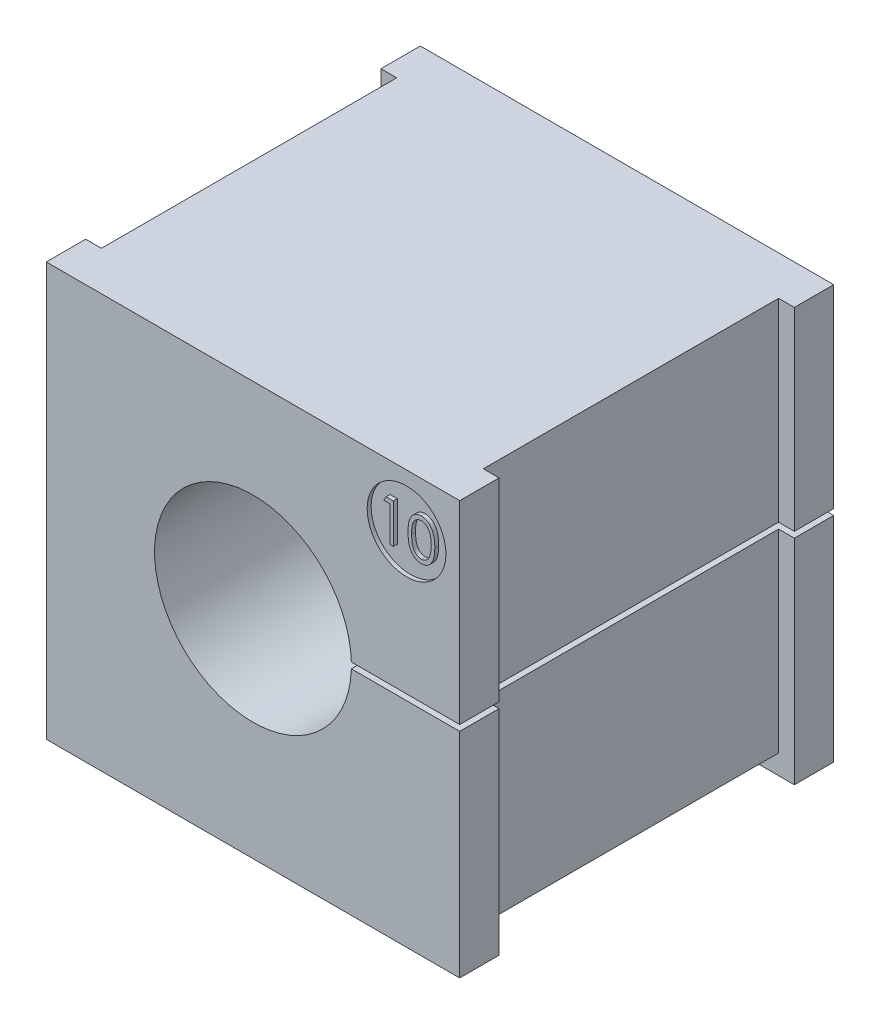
ISO-10303-21;
HEADER;
FILE_DESCRIPTION(('STEP AP214'),'2;1');
FILE_NAME('part.step','',(''),(''),'','','');
FILE_SCHEMA(('AUTOMOTIVE_DESIGN { 1 0 10303 214 1 1 1 1 }'));
ENDSEC;
DATA;
#1=APPLICATION_CONTEXT('core data for automotive mechanical design processes');
#2=APPLICATION_PROTOCOL_DEFINITION('international standard','automotive_design',2000,#1);
#3=PRODUCT_CONTEXT('',#1,'mechanical');
#4=PRODUCT('Part','Part','',(#3));
#5=PRODUCT_RELATED_PRODUCT_CATEGORY('part','',(#4));
#6=PRODUCT_DEFINITION_FORMATION('','',#4);
#7=PRODUCT_DEFINITION_CONTEXT('part definition',#1,'design');
#8=PRODUCT_DEFINITION('design','',#6,#7);
#9=PRODUCT_DEFINITION_SHAPE('','',#8);
#10=(LENGTH_UNIT() NAMED_UNIT(*) SI_UNIT(.MILLI.,.METRE.));
#11=(NAMED_UNIT(*) PLANE_ANGLE_UNIT() SI_UNIT($,.RADIAN.));
#12=(NAMED_UNIT(*) SI_UNIT($,.STERADIAN.) SOLID_ANGLE_UNIT());
#13=UNCERTAINTY_MEASURE_WITH_UNIT(LENGTH_MEASURE(1.E-05),#10,'distance_accuracy_value','');
#14=(GEOMETRIC_REPRESENTATION_CONTEXT(3) GLOBAL_UNCERTAINTY_ASSIGNED_CONTEXT((#13)) GLOBAL_UNIT_ASSIGNED_CONTEXT((#10,
#11,#12)) REPRESENTATION_CONTEXT('',''));
#15=CARTESIAN_POINT('',(0.,0.,0.));
#16=DIRECTION('',(0.,0.,1.));
#17=DIRECTION('',(1.,0.,0.));
#18=AXIS2_PLACEMENT_3D('',#15,#16,#17);
#19=CARTESIAN_POINT('',(0.,0.,-9.14213562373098));
#20=DIRECTION('',(0.,0.,1.));
#21=DIRECTION('',(-1.,0.,0.));
#22=AXIS2_PLACEMENT_3D('',#19,#20,#21);
#23=CYLINDRICAL_SURFACE('',#22,5.);
#24=CARTESIAN_POINT('',(0.,0.,5.));
#25=DIRECTION('',(0.,0.,1.));
#26=DIRECTION('',(1.,0.,0.));
#27=AXIS2_PLACEMENT_3D('',#24,#25,#26);
#28=CIRCLE('',#27,5.);
#29=CARTESIAN_POINT('',(4.99774949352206,0.149999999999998,5.));
#30=VERTEX_POINT('',#29);
#31=CARTESIAN_POINT('',(4.99774949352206,-0.15,5.));
#32=VERTEX_POINT('',#31);
#33=EDGE_CURVE('E40',#30,#32,#28,.T.);
#34=ORIENTED_EDGE('',*,*,#33,.F.);
#35=DIRECTION('',(0.,0.,1.));
#36=VECTOR('',#35,1.);
#37=CARTESIAN_POINT('',(4.99774949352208,0.149999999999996,-9.14213562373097));
#38=LINE('',#37,#36);
#39=CARTESIAN_POINT('',(4.99774949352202,0.15,24.));
#40=VERTEX_POINT('',#39);
#41=EDGE_CURVE('E11',#30,#40,#38,.T.);
#42=ORIENTED_EDGE('',*,*,#41,.T.);
#43=CARTESIAN_POINT('',(0.,0.,24.));
#44=DIRECTION('',(0.,0.,1.));
#45=DIRECTION('',(-1.,0.,0.));
#46=AXIS2_PLACEMENT_3D('',#43,#44,#45);
#47=CIRCLE('',#46,5.);
#48=CARTESIAN_POINT('',(4.99774949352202,-0.149999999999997,24.));
#49=VERTEX_POINT('',#48);
#50=EDGE_CURVE('E26',#40,#49,#47,.T.);
#51=ORIENTED_EDGE('',*,*,#50,.T.);
#52=DIRECTION('',(0.,0.,-1.));
#53=VECTOR('',#52,1.);
#54=CARTESIAN_POINT('',(4.99774949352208,-0.150000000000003,-9.14213562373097));
#55=LINE('',#54,#53);
#56=EDGE_CURVE('E406',#49,#32,#55,.T.);
#57=ORIENTED_EDGE('',*,*,#56,.T.);
#58=EDGE_LOOP('',(#34,#42,#51,#57));
#59=FACE_BOUND('',#58,.T.);
#60=ADVANCED_FACE('F16',(#59),#23,.F.);
#61=CARTESIAN_POINT('',(7.8,7.3,23.8));
#62=DIRECTION('',(0.,0.,1.));
#63=DIRECTION('',(-1.,0.,0.));
#64=AXIS2_PLACEMENT_3D('',#61,#62,#63);
#65=CYLINDRICAL_SURFACE('',#64,2.);
#66=CARTESIAN_POINT('',(7.8,7.3,23.8));
#67=DIRECTION('',(0.,0.,1.));
#68=DIRECTION('',(-1.,0.,0.));
#69=AXIS2_PLACEMENT_3D('',#66,#67,#68);
#70=CIRCLE('',#69,2.);
#71=CARTESIAN_POINT('',(5.8,7.3,23.8));
#72=VERTEX_POINT('',#71);
#73=EDGE_CURVE('E358',#72,#72,#70,.T.);
#74=ORIENTED_EDGE('',*,*,#73,.F.);
#75=EDGE_LOOP('',(#74));
#76=FACE_BOUND('',#75,.T.);
#77=CARTESIAN_POINT('',(7.8,7.3,24.));
#78=DIRECTION('',(0.,0.,1.));
#79=DIRECTION('',(-1.,0.,0.));
#80=AXIS2_PLACEMENT_3D('',#77,#78,#79);
#81=CIRCLE('',#80,2.);
#82=CARTESIAN_POINT('',(5.8,7.3,24.));
#83=VERTEX_POINT('',#82);
#84=EDGE_CURVE('E407',#83,#83,#81,.T.);
#85=ORIENTED_EDGE('',*,*,#84,.T.);
#86=EDGE_LOOP('',(#85));
#87=FACE_BOUND('',#86,.T.);
#88=ADVANCED_FACE('F1255',(#76,#87),#65,.F.);
#89=CARTESIAN_POINT('',(0.,-9.7,14.5));
#90=DIRECTION('',(0.,-1.,0.));
#91=DIRECTION('',(1.,0.,0.));
#92=AXIS2_PLACEMENT_3D('',#89,#90,#91);
#93=CYLINDRICAL_SURFACE('',#92,2.9);
#94=CARTESIAN_POINT('',(0.,-9.7,14.5));
#95=DIRECTION('',(0.,-1.,0.));
#96=DIRECTION('',(1.,0.,0.));
#97=AXIS2_PLACEMENT_3D('',#94,#95,#96);
#98=CIRCLE('',#97,2.9);
#99=CARTESIAN_POINT('',(2.9,-9.7,14.5));
#100=VERTEX_POINT('',#99);
#101=EDGE_CURVE('E541',#100,#100,#98,.T.);
#102=ORIENTED_EDGE('',*,*,#101,.F.);
#103=EDGE_LOOP('',(#102));
#104=FACE_BOUND('',#103,.T.);
#105=CARTESIAN_POINT('',(0.,-10.,14.5));
#106=DIRECTION('',(0.,1.,0.));
#107=DIRECTION('',(-1.,0.,0.));
#108=AXIS2_PLACEMENT_3D('',#105,#106,#107);
#109=CIRCLE('',#108,2.9);
#110=CARTESIAN_POINT('',(2.9,-10.,14.5));
#111=VERTEX_POINT('',#110);
#112=EDGE_CURVE('E560',#111,#111,#109,.T.);
#113=ORIENTED_EDGE('',*,*,#112,.F.);
#114=EDGE_LOOP('',(#113));
#115=FACE_BOUND('',#114,.T.);
#116=ADVANCED_FACE('F1231',(#104,#115),#93,.F.);
#117=CARTESIAN_POINT('',(10.5,0.15,5.));
#118=DIRECTION('',(0.,1.,0.));
#119=DIRECTION('',(0.,0.,-1.));
#120=AXIS2_PLACEMENT_3D('',#117,#118,#119);
#121=PLANE('',#120);
#122=DIRECTION('',(-1.,0.,0.));
#123=VECTOR('',#122,1.);
#124=CARTESIAN_POINT('',(10.5,0.15,24.));
#125=LINE('',#124,#123);
#126=CARTESIAN_POINT('',(10.5,0.15,24.));
#127=VERTEX_POINT('',#126);
#128=EDGE_CURVE('E411',#127,#40,#125,.T.);
#129=ORIENTED_EDGE('',*,*,#128,.T.);
#130=ORIENTED_EDGE('',*,*,#41,.F.);
#131=DIRECTION('',(-1.,0.,0.));
#132=VECTOR('',#131,1.);
#133=CARTESIAN_POINT('',(10.5,0.15,5.));
#134=LINE('',#133,#132);
#135=CARTESIAN_POINT('',(10.5,0.15,5.));
#136=VERTEX_POINT('',#135);
#137=EDGE_CURVE('E454',#136,#30,#134,.T.);
#138=ORIENTED_EDGE('',*,*,#137,.F.);
#139=DIRECTION('',(0.,0.,1.));
#140=VECTOR('',#139,1.);
#141=CARTESIAN_POINT('',(10.5,0.15,5.));
#142=LINE('',#141,#140);
#143=CARTESIAN_POINT('',(10.5,0.15,7.));
#144=VERTEX_POINT('',#143);
#145=EDGE_CURVE('E310',#136,#144,#142,.T.);
#146=ORIENTED_EDGE('',*,*,#145,.T.);
#147=DIRECTION('',(1.,0.,0.));
#148=VECTOR('',#147,1.);
#149=CARTESIAN_POINT('',(10.5,0.15,7.));
#150=LINE('',#149,#148);
#151=CARTESIAN_POINT('',(9.7,0.15,7.));
#152=VERTEX_POINT('',#151);
#153=EDGE_CURVE('E462',#152,#144,#150,.T.);
#154=ORIENTED_EDGE('',*,*,#153,.F.);
#155=DIRECTION('',(0.,0.,-1.));
#156=VECTOR('',#155,1.);
#157=CARTESIAN_POINT('',(9.7,0.15,16.25));
#158=LINE('',#157,#156);
#159=CARTESIAN_POINT('',(9.7,0.15,22.));
#160=VERTEX_POINT('',#159);
#161=EDGE_CURVE('E319',#160,#152,#158,.T.);
#162=ORIENTED_EDGE('',*,*,#161,.F.);
#163=DIRECTION('',(-1.,0.,0.));
#164=VECTOR('',#163,1.);
#165=CARTESIAN_POINT('',(9.2,0.15,22.));
#166=LINE('',#165,#164);
#167=CARTESIAN_POINT('',(10.5,0.15,22.));
#168=VERTEX_POINT('',#167);
#169=EDGE_CURVE('E547',#168,#160,#166,.T.);
#170=ORIENTED_EDGE('',*,*,#169,.F.);
#171=DIRECTION('',(0.,0.,1.));
#172=VECTOR('',#171,1.);
#173=CARTESIAN_POINT('',(10.5,0.15,5.));
#174=LINE('',#173,#172);
#175=EDGE_CURVE('E700',#168,#127,#174,.T.);
#176=ORIENTED_EDGE('',*,*,#175,.T.);
#177=EDGE_LOOP('',(#129,#130,#138,#146,#154,#162,#170,#176));
#178=FACE_BOUND('',#177,.T.);
#179=ADVANCED_FACE('F873',(#178),#121,.F.);
#180=CARTESIAN_POINT('',(10.5,-0.15,5.));
#181=DIRECTION('',(0.,-1.,0.));
#182=DIRECTION('',(-1.,0.,0.));
#183=AXIS2_PLACEMENT_3D('',#180,#181,#182);
#184=PLANE('',#183);
#185=DIRECTION('',(1.,0.,0.));
#186=VECTOR('',#185,1.);
#187=CARTESIAN_POINT('',(10.5,-0.15,5.));
#188=LINE('',#187,#186);
#189=CARTESIAN_POINT('',(10.5,-0.15,5.));
#190=VERTEX_POINT('',#189);
#191=EDGE_CURVE('E418',#32,#190,#188,.T.);
#192=ORIENTED_EDGE('',*,*,#191,.F.);
#193=ORIENTED_EDGE('',*,*,#56,.F.);
#194=DIRECTION('',(1.,0.,0.));
#195=VECTOR('',#194,1.);
#196=CARTESIAN_POINT('',(10.5,-0.149999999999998,24.));
#197=LINE('',#196,#195);
#198=CARTESIAN_POINT('',(10.5,-0.149999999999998,24.));
#199=VERTEX_POINT('',#198);
#200=EDGE_CURVE('E443',#49,#199,#197,.T.);
#201=ORIENTED_EDGE('',*,*,#200,.T.);
#202=DIRECTION('',(0.,0.,1.));
#203=VECTOR('',#202,1.);
#204=CARTESIAN_POINT('',(10.5,-0.15,5.));
#205=LINE('',#204,#203);
#206=CARTESIAN_POINT('',(10.5,-0.149999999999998,22.));
#207=VERTEX_POINT('',#206);
#208=EDGE_CURVE('E416',#207,#199,#205,.T.);
#209=ORIENTED_EDGE('',*,*,#208,.F.);
#210=DIRECTION('',(1.,0.,0.));
#211=VECTOR('',#210,1.);
#212=CARTESIAN_POINT('',(9.2,-0.149999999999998,22.));
#213=LINE('',#212,#211);
#214=CARTESIAN_POINT('',(9.7,-0.149999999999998,22.));
#215=VERTEX_POINT('',#214);
#216=EDGE_CURVE('E289',#215,#207,#213,.T.);
#217=ORIENTED_EDGE('',*,*,#216,.F.);
#218=DIRECTION('',(0.,0.,1.));
#219=VECTOR('',#218,1.);
#220=CARTESIAN_POINT('',(9.7,-0.15,16.25));
#221=LINE('',#220,#219);
#222=CARTESIAN_POINT('',(9.7,-0.15,7.));
#223=VERTEX_POINT('',#222);
#224=EDGE_CURVE('E284',#223,#215,#221,.T.);
#225=ORIENTED_EDGE('',*,*,#224,.F.);
#226=DIRECTION('',(-1.,0.,0.));
#227=VECTOR('',#226,1.);
#228=CARTESIAN_POINT('',(10.5,-0.15,7.));
#229=LINE('',#228,#227);
#230=CARTESIAN_POINT('',(10.5,-0.15,7.));
#231=VERTEX_POINT('',#230);
#232=EDGE_CURVE('E266',#231,#223,#229,.T.);
#233=ORIENTED_EDGE('',*,*,#232,.F.);
#234=DIRECTION('',(0.,0.,1.));
#235=VECTOR('',#234,1.);
#236=CARTESIAN_POINT('',(10.5,-0.15,5.));
#237=LINE('',#236,#235);
#238=EDGE_CURVE('E512',#190,#231,#237,.T.);
#239=ORIENTED_EDGE('',*,*,#238,.F.);
#240=EDGE_LOOP('',(#192,#193,#201,#209,#217,#225,#233,#239));
#241=FACE_BOUND('',#240,.T.);
#242=ADVANCED_FACE('F286',(#241),#184,.F.);
#243=CARTESIAN_POINT('',(10.5,-0.5,24.));
#244=DIRECTION('',(-1.,0.,0.));
#245=DIRECTION('',(0.,-1.,0.));
#246=AXIS2_PLACEMENT_3D('',#243,#244,#245);
#247=PLANE('',#246);
#248=DIRECTION('',(0.,-1.,0.));
#249=VECTOR('',#248,1.);
#250=CARTESIAN_POINT('',(10.5,-0.5,22.));
#251=LINE('',#250,#249);
#252=CARTESIAN_POINT('',(10.5,-11.,22.));
#253=VERTEX_POINT('',#252);
#254=EDGE_CURVE('E374',#207,#253,#251,.T.);
#255=ORIENTED_EDGE('',*,*,#254,.F.);
#256=ORIENTED_EDGE('',*,*,#208,.T.);
#257=DIRECTION('',(0.,1.,0.));
#258=VECTOR('',#257,1.);
#259=CARTESIAN_POINT('',(10.5,-0.5,24.));
#260=LINE('',#259,#258);
#261=CARTESIAN_POINT('',(10.5,-11.,24.));
#262=VERTEX_POINT('',#261);
#263=EDGE_CURVE('E427',#262,#199,#260,.T.);
#264=ORIENTED_EDGE('',*,*,#263,.F.);
#265=DIRECTION('',(0.,0.,-1.));
#266=VECTOR('',#265,1.);
#267=CARTESIAN_POINT('',(10.5,-11.,24.));
#268=LINE('',#267,#266);
#269=EDGE_CURVE('E412',#262,#253,#268,.T.);
#270=ORIENTED_EDGE('',*,*,#269,.T.);
#271=EDGE_LOOP('',(#255,#256,#264,#270));
#272=FACE_BOUND('',#271,.T.);
#273=ADVANCED_FACE('F1344',(#272),#247,.F.);
#274=CARTESIAN_POINT('',(10.5,-0.5,24.));
#275=DIRECTION('',(-1.,0.,0.));
#276=DIRECTION('',(0.,-1.,0.));
#277=AXIS2_PLACEMENT_3D('',#274,#275,#276);
#278=PLANE('',#277);
#279=DIRECTION('',(0.,1.,0.));
#280=VECTOR('',#279,1.);
#281=CARTESIAN_POINT('',(10.5,-0.5,5.));
#282=LINE('',#281,#280);
#283=CARTESIAN_POINT('',(10.5,-11.,5.));
#284=VERTEX_POINT('',#283);
#285=EDGE_CURVE('E417',#284,#190,#282,.T.);
#286=ORIENTED_EDGE('',*,*,#285,.T.);
#287=ORIENTED_EDGE('',*,*,#238,.T.);
#288=DIRECTION('',(0.,-1.,0.));
#289=VECTOR('',#288,1.);
#290=CARTESIAN_POINT('',(10.5,-0.5,7.));
#291=LINE('',#290,#289);
#292=CARTESIAN_POINT('',(10.5,-11.,7.));
#293=VERTEX_POINT('',#292);
#294=EDGE_CURVE('E275',#231,#293,#291,.T.);
#295=ORIENTED_EDGE('',*,*,#294,.T.);
#296=DIRECTION('',(0.,0.,-1.));
#297=VECTOR('',#296,1.);
#298=CARTESIAN_POINT('',(10.5,-11.,24.));
#299=LINE('',#298,#297);
#300=EDGE_CURVE('E299',#293,#284,#299,.T.);
#301=ORIENTED_EDGE('',*,*,#300,.T.);
#302=EDGE_LOOP('',(#286,#287,#295,#301));
#303=FACE_BOUND('',#302,.T.);
#304=ADVANCED_FACE('F1340',(#303),#278,.F.);
#305=CARTESIAN_POINT('',(9.7,-0.5,16.25));
#306=DIRECTION('',(-1.,0.,0.));
#307=DIRECTION('',(0.,-1.,0.));
#308=AXIS2_PLACEMENT_3D('',#305,#306,#307);
#309=PLANE('',#308);
#310=DIRECTION('',(0.,1.,0.));
#311=VECTOR('',#310,1.);
#312=CARTESIAN_POINT('',(9.7,-10.,7.));
#313=LINE('',#312,#311);
#314=CARTESIAN_POINT('',(9.7,-10.,7.));
#315=VERTEX_POINT('',#314);
#316=EDGE_CURVE('E271',#315,#223,#313,.T.);
#317=ORIENTED_EDGE('',*,*,#316,.T.);
#318=ORIENTED_EDGE('',*,*,#224,.T.);
#319=DIRECTION('',(0.,-1.,0.));
#320=VECTOR('',#319,1.);
#321=CARTESIAN_POINT('',(9.7,-10.,22.));
#322=LINE('',#321,#320);
#323=CARTESIAN_POINT('',(9.7,-10.,22.));
#324=VERTEX_POINT('',#323);
#325=EDGE_CURVE('E294',#215,#324,#322,.T.);
#326=ORIENTED_EDGE('',*,*,#325,.T.);
#327=DIRECTION('',(0.,0.,-1.));
#328=VECTOR('',#327,1.);
#329=CARTESIAN_POINT('',(9.7,-10.,16.25));
#330=LINE('',#329,#328);
#331=EDGE_CURVE('E280',#324,#315,#330,.T.);
#332=ORIENTED_EDGE('',*,*,#331,.T.);
#333=EDGE_LOOP('',(#317,#318,#326,#332));
#334=FACE_BOUND('',#333,.T.);
#335=ADVANCED_FACE('F297',(#334),#309,.F.);
#336=CARTESIAN_POINT('',(10.5,-0.5,7.));
#337=DIRECTION('',(0.,0.,-1.));
#338=DIRECTION('',(1.,0.,0.));
#339=AXIS2_PLACEMENT_3D('',#336,#337,#338);
#340=PLANE('',#339);
#341=ORIENTED_EDGE('',*,*,#294,.F.);
#342=ORIENTED_EDGE('',*,*,#232,.T.);
#343=ORIENTED_EDGE('',*,*,#316,.F.);
#344=DIRECTION('',(-1.,0.,0.));
#345=VECTOR('',#344,1.);
#346=CARTESIAN_POINT('',(10.5,-10.,7.));
#347=LINE('',#346,#345);
#348=CARTESIAN_POINT('',(-9.7,-10.,7.));
#349=VERTEX_POINT('',#348);
#350=EDGE_CURVE('E281',#315,#349,#347,.T.);
#351=ORIENTED_EDGE('',*,*,#350,.T.);
#352=DIRECTION('',(0.,-1.,0.));
#353=VECTOR('',#352,1.);
#354=CARTESIAN_POINT('',(-9.7,-10.,7.));
#355=LINE('',#354,#353);
#356=CARTESIAN_POINT('',(-9.7,10.,7.));
#357=VERTEX_POINT('',#356);
#358=EDGE_CURVE('E474',#357,#349,#355,.T.);
#359=ORIENTED_EDGE('',*,*,#358,.F.);
#360=DIRECTION('',(-1.,0.,0.));
#361=VECTOR('',#360,1.);
#362=CARTESIAN_POINT('',(-10.5,10.,7.));
#363=LINE('',#362,#361);
#364=CARTESIAN_POINT('',(-10.5,10.,7.));
#365=VERTEX_POINT('',#364);
#366=EDGE_CURVE('E313',#357,#365,#363,.T.);
#367=ORIENTED_EDGE('',*,*,#366,.T.);
#368=DIRECTION('',(0.,-1.,0.));
#369=VECTOR('',#368,1.);
#370=CARTESIAN_POINT('',(-10.5,10.,7.));
#371=LINE('',#370,#369);
#372=CARTESIAN_POINT('',(-10.5,-11.,7.));
#373=VERTEX_POINT('',#372);
#374=EDGE_CURVE('E323',#365,#373,#371,.T.);
#375=ORIENTED_EDGE('',*,*,#374,.T.);
#376=DIRECTION('',(1.,0.,0.));
#377=VECTOR('',#376,1.);
#378=CARTESIAN_POINT('',(10.5,-11.,7.));
#379=LINE('',#378,#377);
#380=EDGE_CURVE('E378',#373,#293,#379,.T.);
#381=ORIENTED_EDGE('',*,*,#380,.T.);
#382=EDGE_LOOP('',(#341,#342,#343,#351,#359,#367,#375,#381));
#383=FACE_BOUND('',#382,.T.);
#384=ADVANCED_FACE('F268',(#383),#340,.F.);
#385=CARTESIAN_POINT('',(9.2,-0.5,22.));
#386=DIRECTION('',(0.,0.,1.));
#387=DIRECTION('',(-1.,0.,0.));
#388=AXIS2_PLACEMENT_3D('',#385,#386,#387);
#389=PLANE('',#388);
#390=ORIENTED_EDGE('',*,*,#325,.F.);
#391=ORIENTED_EDGE('',*,*,#216,.T.);
#392=ORIENTED_EDGE('',*,*,#254,.T.);
#393=DIRECTION('',(-1.,0.,0.));
#394=VECTOR('',#393,1.);
#395=CARTESIAN_POINT('',(9.2,-11.,22.));
#396=LINE('',#395,#394);
#397=CARTESIAN_POINT('',(-10.5,-11.,22.));
#398=VERTEX_POINT('',#397);
#399=EDGE_CURVE('E371',#253,#398,#396,.T.);
#400=ORIENTED_EDGE('',*,*,#399,.T.);
#401=DIRECTION('',(0.,-1.,0.));
#402=VECTOR('',#401,1.);
#403=CARTESIAN_POINT('',(-10.5,10.,22.));
#404=LINE('',#403,#402);
#405=CARTESIAN_POINT('',(-10.5,10.,22.));
#406=VERTEX_POINT('',#405);
#407=EDGE_CURVE('E228',#406,#398,#404,.T.);
#408=ORIENTED_EDGE('',*,*,#407,.F.);
#409=DIRECTION('',(1.,0.,0.));
#410=VECTOR('',#409,1.);
#411=CARTESIAN_POINT('',(-9.2,10.,22.));
#412=LINE('',#411,#410);
#413=CARTESIAN_POINT('',(-9.7,10.,22.));
#414=VERTEX_POINT('',#413);
#415=EDGE_CURVE('E362',#406,#414,#412,.T.);
#416=ORIENTED_EDGE('',*,*,#415,.T.);
#417=DIRECTION('',(0.,1.,0.));
#418=VECTOR('',#417,1.);
#419=CARTESIAN_POINT('',(-9.7,-10.,22.));
#420=LINE('',#419,#418);
#421=CARTESIAN_POINT('',(-9.7,-10.,22.));
#422=VERTEX_POINT('',#421);
#423=EDGE_CURVE('E475',#422,#414,#420,.T.);
#424=ORIENTED_EDGE('',*,*,#423,.F.);
#425=DIRECTION('',(-1.,0.,0.));
#426=VECTOR('',#425,1.);
#427=CARTESIAN_POINT('',(10.5,-10.,22.));
#428=LINE('',#427,#426);
#429=EDGE_CURVE('E555',#324,#422,#428,.T.);
#430=ORIENTED_EDGE('',*,*,#429,.F.);
#431=EDGE_LOOP('',(#390,#391,#392,#400,#408,#416,#424,#430));
#432=FACE_BOUND('',#431,.T.);
#433=ADVANCED_FACE('F1184',(#432),#389,.F.);
#434=CARTESIAN_POINT('',(7.8,7.3,23.8));
#435=DIRECTION('',(0.,0.,1.));
#436=DIRECTION('',(-1.,0.,0.));
#437=AXIS2_PLACEMENT_3D('',#434,#435,#436);
#438=PLANE('',#437);
#439=ORIENTED_EDGE('',*,*,#73,.T.);
#440=EDGE_LOOP('',(#439));
#441=FACE_BOUND('',#440,.T.);
#442=CARTESIAN_POINT('',(8.54559294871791,6.24871794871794,23.8));
#443=CARTESIAN_POINT('',(8.52981954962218,6.24898572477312,23.8));
#444=CARTESIAN_POINT('',(8.49871748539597,6.24951372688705,23.8));
#445=CARTESIAN_POINT('',(8.45262489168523,6.25493155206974,23.8));
#446=CARTESIAN_POINT('',(8.40778619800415,6.26376619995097,23.8));
#447=CARTESIAN_POINT('',(8.36411176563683,6.27576360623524,23.8));
#448=CARTESIAN_POINT('',(8.32151222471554,6.29101160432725,23.8));
#449=CARTESIAN_POINT('',(8.28040483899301,6.31040646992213,23.8));
#450=CARTESIAN_POINT('',(8.2402468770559,6.33290158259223,23.8));
#451=CARTESIAN_POINT('',(8.20122099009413,6.35849365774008,23.8));
#452=CARTESIAN_POINT('',(8.16407323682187,6.38782275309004,23.8));
#453=CARTESIAN_POINT('',(8.12858217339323,6.4202551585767,23.8));
#454=CARTESIAN_POINT('',(8.09567675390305,6.45662669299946,23.8));
#455=CARTESIAN_POINT('',(8.0648710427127,6.49635683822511,23.8));
#456=CARTESIAN_POINT('',(8.03603945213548,6.53936650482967,23.8));
#457=CARTESIAN_POINT('',(8.00898472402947,6.5855221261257,23.8));
#458=CARTESIAN_POINT('',(7.98480757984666,6.63538633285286,23.8));
#459=CARTESIAN_POINT('',(7.96202452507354,6.68857582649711,23.8));
#460=CARTESIAN_POINT('',(7.94194108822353,6.74639278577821,23.8));
#461=CARTESIAN_POINT('',(7.92440460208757,6.80927022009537,23.8));
#462=CARTESIAN_POINT('',(7.90961974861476,6.87763701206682,23.8));
#463=CARTESIAN_POINT('',(7.89784340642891,6.95149643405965,23.8));
#464=CARTESIAN_POINT('',(7.88819595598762,7.03073414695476,23.8));
#465=CARTESIAN_POINT('',(7.88153177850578,7.11547642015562,23.8));
#466=CARTESIAN_POINT('',(7.87747664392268,7.20554174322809,23.8));
#467=CARTESIAN_POINT('',(7.87711096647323,7.26741003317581,23.8));
#468=CARTESIAN_POINT('',(7.87692307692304,7.29919871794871,23.8));
#469=(BOUNDED_CURVE() B_SPLINE_CURVE(3,(#442,#443,#444,#445,#446,#447,#448,#449,#450,#451,#452,
#453,#454,#455,#456,#457,#458,#459,#460,#461,#462,#463,#464,#465,#466,#467,#468),.UNSPECIFIED.,
.F.,.F.) B_SPLINE_CURVE_WITH_KNOTS((4,1,1,1,1,1,1,1,1,1,1,1,1,1,1,1,1,1,1,1,1,1,1,1,4),(0.,
0.033790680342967,0.066628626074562,0.0992952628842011,0.131650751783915,0.16360888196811,
0.196131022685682,0.228932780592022,0.26219206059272,0.296028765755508,0.330258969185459,
0.365104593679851,0.400999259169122,0.437909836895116,0.476000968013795,0.515551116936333,
0.55658825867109,0.599944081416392,0.646608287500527,0.696400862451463,0.749756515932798,
0.806838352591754,0.867421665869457,0.931879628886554,1.),
.UNSPECIFIED.) CURVE() GEOMETRIC_REPRESENTATION_ITEM() RATIONAL_B_SPLINE_CURVE((1.,1.,1.,1.,1.,
1.,1.,1.,1.,1.,1.,1.,1.,1.,1.,1.,1.,1.,1.,1.,1.,1.,1.,1.,1.,1.,1.)) REPRESENTATION_ITEM(''));
#470=CARTESIAN_POINT('',(8.54559294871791,6.24871794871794,23.8));
#471=VERTEX_POINT('',#470);
#472=CARTESIAN_POINT('',(7.87692307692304,7.29919871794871,23.8));
#473=VERTEX_POINT('',#472);
#474=EDGE_CURVE('E363',#471,#473,#469,.T.);
#475=ORIENTED_EDGE('',*,*,#474,.T.);
#476=CARTESIAN_POINT('',(7.87692307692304,7.29919871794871,23.8));
#477=CARTESIAN_POINT('',(7.87711051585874,7.33125436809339,23.8));
#478=CARTESIAN_POINT('',(7.87747461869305,7.39352293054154,23.8));
#479=CARTESIAN_POINT('',(7.88152514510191,7.48425701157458,23.8));
#480=CARTESIAN_POINT('',(7.88825391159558,7.56937717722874,23.8));
#481=CARTESIAN_POINT('',(7.89747526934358,7.64888749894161,23.8));
#482=CARTESIAN_POINT('',(7.90869696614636,7.72280851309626,23.8));
#483=CARTESIAN_POINT('',(7.92367726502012,7.79094264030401,23.8));
#484=CARTESIAN_POINT('',(7.94071308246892,7.8536053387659,23.8));
#485=CARTESIAN_POINT('',(7.96045757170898,7.91100057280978,23.8));
#486=CARTESIAN_POINT('',(7.98273550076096,7.96390288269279,23.8));
#487=CARTESIAN_POINT('',(8.00698649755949,8.01328601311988,23.8));
#488=CARTESIAN_POINT('',(8.03415628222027,8.05909097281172,23.8));
#489=CARTESIAN_POINT('',(8.06275061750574,8.10199264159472,23.8));
#490=CARTESIAN_POINT('',(8.09377025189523,8.14155927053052,23.8));
#491=CARTESIAN_POINT('',(8.12710731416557,8.17761303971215,23.8));
#492=CARTESIAN_POINT('',(8.16246816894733,8.21071265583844,23.8));
#493=CARTESIAN_POINT('',(8.20002013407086,8.24031383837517,23.8));
#494=CARTESIAN_POINT('',(8.23940529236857,8.26610732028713,23.8));
#495=CARTESIAN_POINT('',(8.27945857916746,8.28948852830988,23.8));
#496=CARTESIAN_POINT('',(8.32132239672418,8.30798370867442,23.8));
#497=CARTESIAN_POINT('',(8.36396415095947,8.32379921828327,23.8));
#498=CARTESIAN_POINT('',(8.40772739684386,8.3363272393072,23.8));
#499=CARTESIAN_POINT('',(8.45263119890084,8.34504146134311,23.8));
#500=CARTESIAN_POINT('',(8.49871585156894,8.35049326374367,23.8));
#501=CARTESIAN_POINT('',(8.52981899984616,8.35101662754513,23.8));
#502=CARTESIAN_POINT('',(8.54559294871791,8.35128205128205,23.8));
#503=(BOUNDED_CURVE() B_SPLINE_CURVE(3,(#476,#477,#478,#479,#480,#481,#482,#483,#484,#485,#486,
#487,#488,#489,#490,#491,#492,#493,#494,#495,#496,#497,#498,#499,#500,#501,#502),.UNSPECIFIED.,
.F.,.F.) B_SPLINE_CURVE_WITH_KNOTS((4,1,1,1,1,1,1,1,1,1,1,1,1,1,1,1,1,1,1,1,1,1,1,1,4),(0.,
0.0685938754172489,0.133244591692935,0.194310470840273,0.251276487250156,0.304510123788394,
0.354231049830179,0.400476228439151,0.443405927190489,0.48400959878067,0.52324660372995,
0.561036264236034,0.597893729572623,0.633511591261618,0.668500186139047,0.702875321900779,
0.737064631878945,0.770672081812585,0.803567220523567,0.83618309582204,0.868461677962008,
0.900847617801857,0.933467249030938,0.966257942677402,1.),
.UNSPECIFIED.) CURVE() GEOMETRIC_REPRESENTATION_ITEM() RATIONAL_B_SPLINE_CURVE((1.,1.,1.,1.,1.,
1.,1.,1.,1.,1.,1.,1.,1.,1.,1.,1.,1.,1.,1.,1.,1.,1.,1.,1.,1.,1.,1.)) REPRESENTATION_ITEM(''));
#504=CARTESIAN_POINT('',(8.54559294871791,8.35128205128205,23.8));
#505=VERTEX_POINT('',#504);
#506=EDGE_CURVE('E391',#473,#505,#503,.T.);
#507=ORIENTED_EDGE('',*,*,#506,.T.);
#508=CARTESIAN_POINT('',(8.54559294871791,8.35128205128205,23.8));
#509=CARTESIAN_POINT('',(8.56150665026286,8.3510613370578,23.8));
#510=CARTESIAN_POINT('',(8.59316931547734,8.35062219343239,23.8));
#511=CARTESIAN_POINT('',(8.63981225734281,8.34444098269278,23.8));
#512=CARTESIAN_POINT('',(8.68564275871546,8.33646271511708,23.8));
#513=CARTESIAN_POINT('',(8.72996548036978,8.32366688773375,23.8));
#514=CARTESIAN_POINT('',(8.77361847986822,8.30835502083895,23.8));
#515=CARTESIAN_POINT('',(8.81551619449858,8.28815125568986,23.8));
#516=CARTESIAN_POINT('',(8.85713783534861,8.26617809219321,23.8));
#517=CARTESIAN_POINT('',(8.89659258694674,8.23937268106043,23.8));
#518=CARTESIAN_POINT('',(8.93505928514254,8.20974829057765,23.8));
#519=CARTESIAN_POINT('',(8.9711177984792,8.17611703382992,23.8));
#520=CARTESIAN_POINT('',(9.00568987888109,8.13940965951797,23.8));
#521=CARTESIAN_POINT('',(9.03746975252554,8.09880748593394,23.8));
#522=CARTESIAN_POINT('',(9.06781946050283,8.05493306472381,23.8));
#523=CARTESIAN_POINT('',(9.09558689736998,8.0074186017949,23.8));
#524=CARTESIAN_POINT('',(9.12134957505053,7.95636939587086,23.8));
#525=CARTESIAN_POINT('',(9.14559176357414,7.90202210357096,23.8));
#526=CARTESIAN_POINT('',(9.16679091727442,7.84292502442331,23.8));
#527=CARTESIAN_POINT('',(9.18563865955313,7.77944676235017,23.8));
#528=CARTESIAN_POINT('',(9.20108757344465,7.71101249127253,23.8));
#529=CARTESIAN_POINT('',(9.2138635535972,7.63800343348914,23.8));
#530=CARTESIAN_POINT('',(9.22378014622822,7.56005790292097,23.8));
#531=CARTESIAN_POINT('',(9.2309972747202,7.47733382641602,23.8));
#532=CARTESIAN_POINT('',(9.23481089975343,7.3897794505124,23.8));
#533=CARTESIAN_POINT('',(9.23552895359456,7.32991780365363,23.8));
#534=CARTESIAN_POINT('',(9.23589743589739,7.29919871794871,23.8));
#535=(BOUNDED_CURVE() B_SPLINE_CURVE(3,(#508,#509,#510,#511,#512,#513,#514,#515,#516,#517,#518,
#519,#520,#521,#522,#523,#524,#525,#526,#527,#528,#529,#530,#531,#532,#533,#534),.UNSPECIFIED.,
.F.,.F.) B_SPLINE_CURVE_WITH_KNOTS((4,1,1,1,1,1,1,1,1,1,1,1,1,1,1,1,1,1,1,1,1,1,1,1,4),(0.,
0.0337879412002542,0.0672261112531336,0.0998413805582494,0.132545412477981,0.165129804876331,
0.198010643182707,0.231279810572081,0.265043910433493,0.299215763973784,0.334358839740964,
0.369695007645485,0.406257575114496,0.44380351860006,0.482981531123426,0.523084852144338,
0.56526677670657,0.609342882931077,0.656392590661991,0.70588701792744,0.758325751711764,
0.813832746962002,0.872795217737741,0.934722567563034,1.),
.UNSPECIFIED.) CURVE() GEOMETRIC_REPRESENTATION_ITEM() RATIONAL_B_SPLINE_CURVE((1.,1.,1.,1.,1.,
1.,1.,1.,1.,1.,1.,1.,1.,1.,1.,1.,1.,1.,1.,1.,1.,1.,1.,1.,1.,1.,1.)) REPRESENTATION_ITEM(''));
#536=CARTESIAN_POINT('',(9.23589743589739,7.29919871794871,23.8));
#537=VERTEX_POINT('',#536);
#538=EDGE_CURVE('E385',#505,#537,#535,.T.);
#539=ORIENTED_EDGE('',*,*,#538,.T.);
#540=CARTESIAN_POINT('',(9.23589743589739,7.29919871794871,23.8));
#541=CARTESIAN_POINT('',(9.23552038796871,7.26861400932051,23.8));
#542=CARTESIAN_POINT('',(9.23478408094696,7.20888755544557,23.8));
#543=CARTESIAN_POINT('',(9.2310840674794,7.12172144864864,23.8));
#544=CARTESIAN_POINT('',(9.22358667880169,7.0394487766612,23.8));
#545=CARTESIAN_POINT('',(9.21444871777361,6.96195034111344,23.8));
#546=CARTESIAN_POINT('',(9.20127356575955,6.88932744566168,23.8));
#547=CARTESIAN_POINT('',(9.18660568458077,6.82119007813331,23.8));
#548=CARTESIAN_POINT('',(9.16789597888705,6.75817847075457,23.8));
#549=CARTESIAN_POINT('',(9.14719966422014,6.69958795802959,23.8));
#550=CARTESIAN_POINT('',(9.12329478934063,6.64547088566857,23.8));
#551=CARTESIAN_POINT('',(9.09772613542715,6.59463239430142,23.8));
#552=CARTESIAN_POINT('',(9.06954419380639,6.54738758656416,23.8));
#553=CARTESIAN_POINT('',(9.03977684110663,6.50323506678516,23.8));
#554=CARTESIAN_POINT('',(9.00739531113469,6.46298110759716,23.8));
#555=CARTESIAN_POINT('',(8.97329109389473,6.42586311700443,23.8));
#556=CARTESIAN_POINT('',(8.93688275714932,6.39217343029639,23.8));
#557=CARTESIAN_POINT('',(8.89821804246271,6.36219925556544,23.8));
#558=CARTESIAN_POINT('',(8.85839037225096,6.33519192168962,23.8));
#559=CARTESIAN_POINT('',(8.81676061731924,6.31243526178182,23.8));
#560=CARTESIAN_POINT('',(8.77430329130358,6.29259609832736,23.8));
#561=CARTESIAN_POINT('',(8.73057678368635,6.27664773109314,23.8));
#562=CARTESIAN_POINT('',(8.68585992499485,6.26404048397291,23.8));
#563=CARTESIAN_POINT('',(8.63999168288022,6.25545816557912,23.8));
#564=CARTESIAN_POINT('',(8.59316307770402,6.24940871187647,23.8));
#565=CARTESIAN_POINT('',(8.56150456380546,6.2489490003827,23.8));
#566=CARTESIAN_POINT('',(8.54559294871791,6.24871794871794,23.8));
#567=(BOUNDED_CURVE() B_SPLINE_CURVE(3,(#540,#541,#542,#543,#544,#545,#546,#547,#548,#549,#550,
#551,#552,#553,#554,#555,#556,#557,#558,#559,#560,#561,#562,#563,#564,#565,#566),.UNSPECIFIED.,
.F.,.F.) B_SPLINE_CURVE_WITH_KNOTS((4,1,1,1,1,1,1,1,1,1,1,1,1,1,1,1,1,1,1,1,1,1,1,1,4),(0.,
0.0650596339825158,0.127049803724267,0.185506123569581,0.24075193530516,0.292964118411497,
0.34244601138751,0.38891824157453,0.432675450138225,0.474525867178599,0.51466986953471,
0.553643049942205,0.591461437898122,0.627838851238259,0.663418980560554,0.698597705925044,
0.733202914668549,0.767395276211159,0.800834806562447,0.834006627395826,0.866988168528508,
0.899725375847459,0.93270569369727,0.966177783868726,1.),
.UNSPECIFIED.) CURVE() GEOMETRIC_REPRESENTATION_ITEM() RATIONAL_B_SPLINE_CURVE((1.,1.,1.,1.,1.,
1.,1.,1.,1.,1.,1.,1.,1.,1.,1.,1.,1.,1.,1.,1.,1.,1.,1.,1.,1.,1.,1.)) REPRESENTATION_ITEM(''));
#568=EDGE_CURVE('E350',#537,#471,#567,.T.);
#569=ORIENTED_EDGE('',*,*,#568,.T.);
#570=EDGE_LOOP('',(#475,#507,#539,#569));
#571=FACE_BOUND('',#570,.T.);
#572=DIRECTION('',(0.496686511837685,0.867930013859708,0.));
#573=VECTOR('',#572,1.);
#574=CARTESIAN_POINT('',(6.64615384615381,8.09487179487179,23.8));
#575=LINE('',#574,#573);
#576=CARTESIAN_POINT('',(6.64615384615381,8.09487179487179,23.8));
#577=VERTEX_POINT('',#576);
#578=CARTESIAN_POINT('',(6.76354166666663,8.3,23.8));
#579=VERTEX_POINT('',#578);
#580=EDGE_CURVE('E343',#577,#579,#575,.T.);
#581=ORIENTED_EDGE('',*,*,#580,.T.);
#582=DIRECTION('',(1.,0.,0.));
#583=VECTOR('',#582,1.);
#584=CARTESIAN_POINT('',(6.76354166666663,8.3,23.8));
#585=LINE('',#584,#583);
#586=CARTESIAN_POINT('',(7.1333333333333,8.3,23.8));
#587=VERTEX_POINT('',#586);
#588=EDGE_CURVE('E351',#579,#587,#585,.T.);
#589=ORIENTED_EDGE('',*,*,#588,.T.);
#590=DIRECTION('',(0.,-1.,0.));
#591=VECTOR('',#590,1.);
#592=CARTESIAN_POINT('',(7.1333333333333,8.3,23.8));
#593=LINE('',#592,#591);
#594=CARTESIAN_POINT('',(7.1333333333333,6.3,23.8));
#595=VERTEX_POINT('',#594);
#596=EDGE_CURVE('E364',#587,#595,#593,.T.);
#597=ORIENTED_EDGE('',*,*,#596,.T.);
#598=DIRECTION('',(-1.,0.,0.));
#599=VECTOR('',#598,1.);
#600=CARTESIAN_POINT('',(7.1333333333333,6.3,23.8));
#601=LINE('',#600,#599);
#602=CARTESIAN_POINT('',(6.95384615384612,6.3,23.8));
#603=VERTEX_POINT('',#602);
#604=EDGE_CURVE('E368',#595,#603,#601,.T.);
#605=ORIENTED_EDGE('',*,*,#604,.T.);
#606=DIRECTION('',(0.,1.,0.));
#607=VECTOR('',#606,1.);
#608=CARTESIAN_POINT('',(6.95384615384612,6.3,23.8));
#609=LINE('',#608,#607);
#610=CARTESIAN_POINT('',(6.95384615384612,8.09487179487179,23.8));
#611=VERTEX_POINT('',#610);
#612=EDGE_CURVE('E435',#603,#611,#609,.T.);
#613=ORIENTED_EDGE('',*,*,#612,.T.);
#614=DIRECTION('',(-1.,0.,0.));
#615=VECTOR('',#614,1.);
#616=CARTESIAN_POINT('',(6.95384615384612,8.09487179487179,23.8));
#617=LINE('',#616,#615);
#618=EDGE_CURVE('E559',#611,#577,#617,.T.);
#619=ORIENTED_EDGE('',*,*,#618,.T.);
#620=EDGE_LOOP('',(#581,#589,#597,#605,#613,#619));
#621=FACE_BOUND('',#620,.T.);
#622=ADVANCED_FACE('F1188',(#441,#571,#621),#438,.T.);
#623=CARTESIAN_POINT('',(10.5,-10.,22.));
#624=DIRECTION('',(0.,1.,0.));
#625=DIRECTION('',(0.,0.,-1.));
#626=AXIS2_PLACEMENT_3D('',#623,#624,#625);
#627=PLANE('',#626);
#628=ORIENTED_EDGE('',*,*,#429,.T.);
#629=DIRECTION('',(0.,0.,1.));
#630=VECTOR('',#629,1.);
#631=CARTESIAN_POINT('',(-9.7,-10.,9.));
#632=LINE('',#631,#630);
#633=EDGE_CURVE('E470',#349,#422,#632,.T.);
#634=ORIENTED_EDGE('',*,*,#633,.F.);
#635=ORIENTED_EDGE('',*,*,#350,.F.);
#636=ORIENTED_EDGE('',*,*,#331,.F.);
#637=EDGE_LOOP('',(#628,#634,#635,#636));
#638=FACE_BOUND('',#637,.T.);
#639=ORIENTED_EDGE('',*,*,#112,.T.);
#640=EDGE_LOOP('',(#639));
#641=FACE_BOUND('',#640,.T.);
#642=ADVANCED_FACE('F1204',(#638,#641),#627,.F.);
#643=CARTESIAN_POINT('',(10.5,-11.,24.));
#644=DIRECTION('',(0.,1.,0.));
#645=DIRECTION('',(1.,0.,0.));
#646=AXIS2_PLACEMENT_3D('',#643,#644,#645);
#647=PLANE('',#646);
#648=DIRECTION('',(0.,0.,-1.));
#649=VECTOR('',#648,1.);
#650=CARTESIAN_POINT('',(-10.5,-11.,24.));
#651=LINE('',#650,#649);
#652=CARTESIAN_POINT('',(-10.5,-11.,24.));
#653=VERTEX_POINT('',#652);
#654=EDGE_CURVE('E628',#653,#398,#651,.T.);
#655=ORIENTED_EDGE('',*,*,#654,.T.);
#656=ORIENTED_EDGE('',*,*,#399,.F.);
#657=ORIENTED_EDGE('',*,*,#269,.F.);
#658=DIRECTION('',(1.,0.,0.));
#659=VECTOR('',#658,1.);
#660=CARTESIAN_POINT('',(10.5,-11.,24.));
#661=LINE('',#660,#659);
#662=EDGE_CURVE('E421',#653,#262,#661,.T.);
#663=ORIENTED_EDGE('',*,*,#662,.F.);
#664=EDGE_LOOP('',(#655,#656,#657,#663));
#665=FACE_BOUND('',#664,.T.);
#666=ADVANCED_FACE('F761',(#665),#647,.F.);
#667=CARTESIAN_POINT('',(10.5,-11.,24.));
#668=DIRECTION('',(0.,1.,0.));
#669=DIRECTION('',(1.,0.,0.));
#670=AXIS2_PLACEMENT_3D('',#667,#668,#669);
#671=PLANE('',#670);
#672=ORIENTED_EDGE('',*,*,#380,.F.);
#673=DIRECTION('',(0.,0.,-1.));
#674=VECTOR('',#673,1.);
#675=CARTESIAN_POINT('',(-10.5,-11.,24.));
#676=LINE('',#675,#674);
#677=CARTESIAN_POINT('',(-10.5,-11.,5.));
#678=VERTEX_POINT('',#677);
#679=EDGE_CURVE('E624',#373,#678,#676,.T.);
#680=ORIENTED_EDGE('',*,*,#679,.T.);
#681=DIRECTION('',(1.,0.,0.));
#682=VECTOR('',#681,1.);
#683=CARTESIAN_POINT('',(10.5,-11.,5.));
#684=LINE('',#683,#682);
#685=EDGE_CURVE('E629',#678,#284,#684,.T.);
#686=ORIENTED_EDGE('',*,*,#685,.T.);
#687=ORIENTED_EDGE('',*,*,#300,.F.);
#688=EDGE_LOOP('',(#672,#680,#686,#687));
#689=FACE_BOUND('',#688,.T.);
#690=ADVANCED_FACE('F1203',(#689),#671,.F.);
#691=CARTESIAN_POINT('',(-9.7,10.,9.));
#692=DIRECTION('',(-1.,0.,0.));
#693=DIRECTION('',(0.,-1.,0.));
#694=AXIS2_PLACEMENT_3D('',#691,#692,#693);
#695=PLANE('',#694);
#696=DIRECTION('',(0.,0.,-1.));
#697=VECTOR('',#696,1.);
#698=CARTESIAN_POINT('',(-9.7,10.,16.25));
#699=LINE('',#698,#697);
#700=EDGE_CURVE('E657',#414,#357,#699,.T.);
#701=ORIENTED_EDGE('',*,*,#700,.T.);
#702=ORIENTED_EDGE('',*,*,#358,.T.);
#703=ORIENTED_EDGE('',*,*,#633,.T.);
#704=ORIENTED_EDGE('',*,*,#423,.T.);
#705=EDGE_LOOP('',(#701,#702,#703,#704));
#706=FACE_BOUND('',#705,.T.);
#707=ADVANCED_FACE('F1236',(#706),#695,.T.);
#708=CARTESIAN_POINT('',(10.5,10.,24.));
#709=DIRECTION('',(0.,1.,0.));
#710=DIRECTION('',(1.,0.,0.));
#711=AXIS2_PLACEMENT_3D('',#708,#709,#710);
#712=PLANE('',#711);
#713=DIRECTION('',(0.,0.,-1.));
#714=VECTOR('',#713,1.);
#715=CARTESIAN_POINT('',(9.7,10.,16.25));
#716=LINE('',#715,#714);
#717=CARTESIAN_POINT('',(9.7,10.,22.));
#718=VERTEX_POINT('',#717);
#719=CARTESIAN_POINT('',(9.7,10.,7.));
#720=VERTEX_POINT('',#719);
#721=EDGE_CURVE('E581',#718,#720,#716,.T.);
#722=ORIENTED_EDGE('',*,*,#721,.T.);
#723=DIRECTION('',(1.,0.,0.));
#724=VECTOR('',#723,1.);
#725=CARTESIAN_POINT('',(10.5,10.,7.));
#726=LINE('',#725,#724);
#727=CARTESIAN_POINT('',(10.5,10.,7.));
#728=VERTEX_POINT('',#727);
#729=EDGE_CURVE('E641',#720,#728,#726,.T.);
#730=ORIENTED_EDGE('',*,*,#729,.T.);
#731=DIRECTION('',(0.,0.,-1.));
#732=VECTOR('',#731,1.);
#733=CARTESIAN_POINT('',(10.5,10.,24.));
#734=LINE('',#733,#732);
#735=CARTESIAN_POINT('',(10.5,10.,5.));
#736=VERTEX_POINT('',#735);
#737=EDGE_CURVE('E498',#728,#736,#734,.T.);
#738=ORIENTED_EDGE('',*,*,#737,.T.);
#739=DIRECTION('',(1.,0.,0.));
#740=VECTOR('',#739,1.);
#741=CARTESIAN_POINT('',(10.5,10.,5.));
#742=LINE('',#741,#740);
#743=CARTESIAN_POINT('',(-10.5,10.,5.));
#744=VERTEX_POINT('',#743);
#745=EDGE_CURVE('E461',#744,#736,#742,.T.);
#746=ORIENTED_EDGE('',*,*,#745,.F.);
#747=DIRECTION('',(0.,0.,-1.));
#748=VECTOR('',#747,1.);
#749=CARTESIAN_POINT('',(-10.5,10.,24.));
#750=LINE('',#749,#748);
#751=EDGE_CURVE('E595',#365,#744,#750,.T.);
#752=ORIENTED_EDGE('',*,*,#751,.F.);
#753=ORIENTED_EDGE('',*,*,#366,.F.);
#754=ORIENTED_EDGE('',*,*,#700,.F.);
#755=ORIENTED_EDGE('',*,*,#415,.F.);
#756=DIRECTION('',(0.,0.,-1.));
#757=VECTOR('',#756,1.);
#758=CARTESIAN_POINT('',(-10.5,10.,24.));
#759=LINE('',#758,#757);
#760=CARTESIAN_POINT('',(-10.5,10.,24.));
#761=VERTEX_POINT('',#760);
#762=EDGE_CURVE('E592',#761,#406,#759,.T.);
#763=ORIENTED_EDGE('',*,*,#762,.F.);
#764=DIRECTION('',(1.,0.,0.));
#765=VECTOR('',#764,1.);
#766=CARTESIAN_POINT('',(10.5,10.,24.));
#767=LINE('',#766,#765);
#768=CARTESIAN_POINT('',(10.5,10.,24.));
#769=VERTEX_POINT('',#768);
#770=EDGE_CURVE('E491',#761,#769,#767,.T.);
#771=ORIENTED_EDGE('',*,*,#770,.T.);
#772=DIRECTION('',(0.,0.,-1.));
#773=VECTOR('',#772,1.);
#774=CARTESIAN_POINT('',(10.5,10.,24.));
#775=LINE('',#774,#773);
#776=CARTESIAN_POINT('',(10.5,10.,22.));
#777=VERTEX_POINT('',#776);
#778=EDGE_CURVE('E499',#769,#777,#775,.T.);
#779=ORIENTED_EDGE('',*,*,#778,.T.);
#780=DIRECTION('',(-1.,0.,0.));
#781=VECTOR('',#780,1.);
#782=CARTESIAN_POINT('',(9.2,10.,22.));
#783=LINE('',#782,#781);
#784=EDGE_CURVE('E672',#777,#718,#783,.T.);
#785=ORIENTED_EDGE('',*,*,#784,.T.);
#786=EDGE_LOOP('',(#722,#730,#738,#746,#752,#753,#754,#755,#763,#771,#779,#785));
#787=FACE_BOUND('',#786,.T.);
#788=ADVANCED_FACE('F862',(#787),#712,.T.);
#789=CARTESIAN_POINT('',(-10.5,-0.5,24.));
#790=DIRECTION('',(-1.,0.,0.));
#791=DIRECTION('',(0.,-1.,0.));
#792=AXIS2_PLACEMENT_3D('',#789,#790,#791);
#793=PLANE('',#792);
#794=ORIENTED_EDGE('',*,*,#374,.F.);
#795=ORIENTED_EDGE('',*,*,#751,.T.);
#796=DIRECTION('',(0.,1.,0.));
#797=VECTOR('',#796,1.);
#798=CARTESIAN_POINT('',(-10.5,-0.5,5.));
#799=LINE('',#798,#797);
#800=EDGE_CURVE('E422',#678,#744,#799,.T.);
#801=ORIENTED_EDGE('',*,*,#800,.F.);
#802=ORIENTED_EDGE('',*,*,#679,.F.);
#803=EDGE_LOOP('',(#794,#795,#801,#802));
#804=FACE_BOUND('',#803,.T.);
#805=ADVANCED_FACE('F1212',(#804),#793,.T.);
#806=CARTESIAN_POINT('',(-10.5,-0.5,24.));
#807=DIRECTION('',(-1.,0.,0.));
#808=DIRECTION('',(0.,-1.,0.));
#809=AXIS2_PLACEMENT_3D('',#806,#807,#808);
#810=PLANE('',#809);
#811=ORIENTED_EDGE('',*,*,#762,.T.);
#812=ORIENTED_EDGE('',*,*,#407,.T.);
#813=ORIENTED_EDGE('',*,*,#654,.F.);
#814=DIRECTION('',(0.,1.,0.));
#815=VECTOR('',#814,1.);
#816=CARTESIAN_POINT('',(-10.5,-0.5,24.));
#817=LINE('',#816,#815);
#818=EDGE_CURVE('E448',#653,#761,#817,.T.);
#819=ORIENTED_EDGE('',*,*,#818,.T.);
#820=EDGE_LOOP('',(#811,#812,#813,#819));
#821=FACE_BOUND('',#820,.T.);
#822=ADVANCED_FACE('F765',(#821),#810,.T.);
#823=CARTESIAN_POINT('',(10.5,-0.5,24.));
#824=DIRECTION('',(-1.,0.,0.));
#825=DIRECTION('',(0.,-1.,0.));
#826=AXIS2_PLACEMENT_3D('',#823,#824,#825);
#827=PLANE('',#826);
#828=DIRECTION('',(0.,1.,0.));
#829=VECTOR('',#828,1.);
#830=CARTESIAN_POINT('',(10.5,-0.5,24.));
#831=LINE('',#830,#829);
#832=EDGE_CURVE('E423',#127,#769,#831,.T.);
#833=ORIENTED_EDGE('',*,*,#832,.F.);
#834=ORIENTED_EDGE('',*,*,#175,.F.);
#835=DIRECTION('',(0.,-1.,0.));
#836=VECTOR('',#835,1.);
#837=CARTESIAN_POINT('',(10.5,-0.5,22.));
#838=LINE('',#837,#836);
#839=EDGE_CURVE('E465',#777,#168,#838,.T.);
#840=ORIENTED_EDGE('',*,*,#839,.F.);
#841=ORIENTED_EDGE('',*,*,#778,.F.);
#842=EDGE_LOOP('',(#833,#834,#840,#841));
#843=FACE_BOUND('',#842,.T.);
#844=ADVANCED_FACE('F1175',(#843),#827,.F.);
#845=CARTESIAN_POINT('',(10.5,-0.5,24.));
#846=DIRECTION('',(-1.,0.,0.));
#847=DIRECTION('',(0.,-1.,0.));
#848=AXIS2_PLACEMENT_3D('',#845,#846,#847);
#849=PLANE('',#848);
#850=DIRECTION('',(0.,-1.,0.));
#851=VECTOR('',#850,1.);
#852=CARTESIAN_POINT('',(10.5,-0.5,7.));
#853=LINE('',#852,#851);
#854=EDGE_CURVE('E444',#728,#144,#853,.T.);
#855=ORIENTED_EDGE('',*,*,#854,.T.);
#856=ORIENTED_EDGE('',*,*,#145,.F.);
#857=DIRECTION('',(0.,1.,0.));
#858=VECTOR('',#857,1.);
#859=CARTESIAN_POINT('',(10.5,-0.5,5.));
#860=LINE('',#859,#858);
#861=EDGE_CURVE('E318',#136,#736,#860,.T.);
#862=ORIENTED_EDGE('',*,*,#861,.T.);
#863=ORIENTED_EDGE('',*,*,#737,.F.);
#864=EDGE_LOOP('',(#855,#856,#862,#863));
#865=FACE_BOUND('',#864,.T.);
#866=ADVANCED_FACE('F857',(#865),#849,.F.);
#867=CARTESIAN_POINT('',(9.7,-0.5,16.25));
#868=DIRECTION('',(-1.,0.,0.));
#869=DIRECTION('',(0.,-1.,0.));
#870=AXIS2_PLACEMENT_3D('',#867,#868,#869);
#871=PLANE('',#870);
#872=DIRECTION('',(0.,-1.,0.));
#873=VECTOR('',#872,1.);
#874=CARTESIAN_POINT('',(9.7,-10.,22.));
#875=LINE('',#874,#873);
#876=EDGE_CURVE('E314',#718,#160,#875,.T.);
#877=ORIENTED_EDGE('',*,*,#876,.T.);
#878=ORIENTED_EDGE('',*,*,#161,.T.);
#879=DIRECTION('',(0.,1.,0.));
#880=VECTOR('',#879,1.);
#881=CARTESIAN_POINT('',(9.7,-10.,7.));
#882=LINE('',#881,#880);
#883=EDGE_CURVE('E382',#152,#720,#882,.T.);
#884=ORIENTED_EDGE('',*,*,#883,.T.);
#885=ORIENTED_EDGE('',*,*,#721,.F.);
#886=EDGE_LOOP('',(#877,#878,#884,#885));
#887=FACE_BOUND('',#886,.T.);
#888=ADVANCED_FACE('F1350',(#887),#871,.F.);
#889=CARTESIAN_POINT('',(10.5,-0.5,24.));
#890=DIRECTION('',(0.,0.,-1.));
#891=DIRECTION('',(0.,1.,0.));
#892=AXIS2_PLACEMENT_3D('',#889,#890,#891);
#893=PLANE('',#892);
#894=ORIENTED_EDGE('',*,*,#263,.T.);
#895=ORIENTED_EDGE('',*,*,#200,.F.);
#896=ORIENTED_EDGE('',*,*,#50,.F.);
#897=ORIENTED_EDGE('',*,*,#128,.F.);
#898=ORIENTED_EDGE('',*,*,#832,.T.);
#899=ORIENTED_EDGE('',*,*,#770,.F.);
#900=ORIENTED_EDGE('',*,*,#818,.F.);
#901=ORIENTED_EDGE('',*,*,#662,.T.);
#902=EDGE_LOOP('',(#894,#895,#896,#897,#898,#899,#900,#901));
#903=FACE_BOUND('',#902,.T.);
#904=ORIENTED_EDGE('',*,*,#84,.F.);
#905=EDGE_LOOP('',(#904));
#906=FACE_BOUND('',#905,.T.);
#907=ADVANCED_FACE('F768',(#903,#906),#893,.F.);
#908=CARTESIAN_POINT('',(10.5,-0.5,5.));
#909=DIRECTION('',(0.,0.,-1.));
#910=DIRECTION('',(0.,1.,0.));
#911=AXIS2_PLACEMENT_3D('',#908,#909,#910);
#912=PLANE('',#911);
#913=ORIENTED_EDGE('',*,*,#191,.T.);
#914=ORIENTED_EDGE('',*,*,#285,.F.);
#915=ORIENTED_EDGE('',*,*,#685,.F.);
#916=ORIENTED_EDGE('',*,*,#800,.T.);
#917=ORIENTED_EDGE('',*,*,#745,.T.);
#918=ORIENTED_EDGE('',*,*,#861,.F.);
#919=ORIENTED_EDGE('',*,*,#137,.T.);
#920=ORIENTED_EDGE('',*,*,#33,.T.);
#921=EDGE_LOOP('',(#913,#914,#915,#916,#917,#918,#919,#920));
#922=FACE_BOUND('',#921,.T.);
#923=ADVANCED_FACE('F1362',(#922),#912,.T.);
#924=CARTESIAN_POINT('',(10.5,-0.5,7.));
#925=DIRECTION('',(0.,0.,-1.));
#926=DIRECTION('',(1.,0.,0.));
#927=AXIS2_PLACEMENT_3D('',#924,#925,#926);
#928=PLANE('',#927);
#929=ORIENTED_EDGE('',*,*,#883,.F.);
#930=ORIENTED_EDGE('',*,*,#153,.T.);
#931=ORIENTED_EDGE('',*,*,#854,.F.);
#932=ORIENTED_EDGE('',*,*,#729,.F.);
#933=EDGE_LOOP('',(#929,#930,#931,#932));
#934=FACE_BOUND('',#933,.T.);
#935=ADVANCED_FACE('F868',(#934),#928,.F.);
#936=CARTESIAN_POINT('',(9.2,-0.5,22.));
#937=DIRECTION('',(0.,0.,1.));
#938=DIRECTION('',(-1.,0.,0.));
#939=AXIS2_PLACEMENT_3D('',#936,#937,#938);
#940=PLANE('',#939);
#941=ORIENTED_EDGE('',*,*,#839,.T.);
#942=ORIENTED_EDGE('',*,*,#169,.T.);
#943=ORIENTED_EDGE('',*,*,#876,.F.);
#944=ORIENTED_EDGE('',*,*,#784,.F.);
#945=EDGE_LOOP('',(#941,#942,#943,#944));
#946=FACE_BOUND('',#945,.T.);
#947=ADVANCED_FACE('F1275',(#946),#940,.F.);
#948=CARTESIAN_POINT('',(0.,-9.7,14.5));
#949=DIRECTION('',(0.,-1.,0.));
#950=DIRECTION('',(-1.,0.,0.));
#951=AXIS2_PLACEMENT_3D('',#948,#949,#950);
#952=PLANE('',#951);
#953=ORIENTED_EDGE('',*,*,#101,.T.);
#954=EDGE_LOOP('',(#953));
#955=FACE_BOUND('',#954,.T.);
#956=ADVANCED_FACE('F1271',(#955),#952,.T.);
#957=CARTESIAN_POINT('',(6.64615384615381,8.09487179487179,24.));
#958=DIRECTION('',(-0.867930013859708,0.496686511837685,0.));
#959=DIRECTION('',(0.,0.,-1.));
#960=AXIS2_PLACEMENT_3D('',#957,#958,#959);
#961=PLANE('',#960);
#962=ORIENTED_EDGE('',*,*,#580,.F.);
#963=DIRECTION('',(0.,0.,-1.));
#964=VECTOR('',#963,1.);
#965=CARTESIAN_POINT('',(6.64615384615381,8.09487179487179,24.));
#966=LINE('',#965,#964);
#967=CARTESIAN_POINT('',(6.64615384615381,8.09487179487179,24.));
#968=VERTEX_POINT('',#967);
#969=EDGE_CURVE('E328',#968,#577,#966,.T.);
#970=ORIENTED_EDGE('',*,*,#969,.F.);
#971=DIRECTION('',(0.496686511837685,0.867930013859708,0.));
#972=VECTOR('',#971,1.);
#973=CARTESIAN_POINT('',(6.64615384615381,8.09487179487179,24.));
#974=LINE('',#973,#972);
#975=CARTESIAN_POINT('',(6.76354166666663,8.3,24.));
#976=VERTEX_POINT('',#975);
#977=EDGE_CURVE('E548',#968,#976,#974,.T.);
#978=ORIENTED_EDGE('',*,*,#977,.T.);
#979=DIRECTION('',(0.,0.,-1.));
#980=VECTOR('',#979,1.);
#981=CARTESIAN_POINT('',(6.76354166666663,8.3,24.));
#982=LINE('',#981,#980);
#983=EDGE_CURVE('E19',#976,#579,#982,.T.);
#984=ORIENTED_EDGE('',*,*,#983,.T.);
#985=EDGE_LOOP('',(#962,#970,#978,#984));
#986=FACE_BOUND('',#985,.T.);
#987=ADVANCED_FACE('F804',(#986),#961,.T.);
#988=CARTESIAN_POINT('',(6.95384615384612,8.09487179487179,24.));
#989=DIRECTION('',(0.,-1.,0.));
#990=DIRECTION('',(-1.,0.,0.));
#991=AXIS2_PLACEMENT_3D('',#988,#989,#990);
#992=PLANE('',#991);
#993=ORIENTED_EDGE('',*,*,#618,.F.);
#994=DIRECTION('',(0.,0.,-1.));
#995=VECTOR('',#994,1.);
#996=CARTESIAN_POINT('',(6.95384615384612,8.09487179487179,24.));
#997=LINE('',#996,#995);
#998=CARTESIAN_POINT('',(6.95384615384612,8.09487179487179,24.));
#999=VERTEX_POINT('',#998);
#1000=EDGE_CURVE('E329',#999,#611,#997,.T.);
#1001=ORIENTED_EDGE('',*,*,#1000,.F.);
#1002=DIRECTION('',(-1.,0.,0.));
#1003=VECTOR('',#1002,1.);
#1004=CARTESIAN_POINT('',(6.95384615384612,8.09487179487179,24.));
#1005=LINE('',#1004,#1003);
#1006=EDGE_CURVE('E732',#999,#968,#1005,.T.);
#1007=ORIENTED_EDGE('',*,*,#1006,.T.);
#1008=ORIENTED_EDGE('',*,*,#969,.T.);
#1009=EDGE_LOOP('',(#993,#1001,#1007,#1008));
#1010=FACE_BOUND('',#1009,.T.);
#1011=ADVANCED_FACE('F789',(#1010),#992,.T.);
#1012=CARTESIAN_POINT('',(6.95384615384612,6.3,24.));
#1013=DIRECTION('',(-1.,0.,0.));
#1014=DIRECTION('',(0.,-1.,0.));
#1015=AXIS2_PLACEMENT_3D('',#1012,#1013,#1014);
#1016=PLANE('',#1015);
#1017=ORIENTED_EDGE('',*,*,#612,.F.);
#1018=DIRECTION('',(0.,0.,-1.));
#1019=VECTOR('',#1018,1.);
#1020=CARTESIAN_POINT('',(6.95384615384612,6.3,24.));
#1021=LINE('',#1020,#1019);
#1022=CARTESIAN_POINT('',(6.95384615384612,6.3,24.));
#1023=VERTEX_POINT('',#1022);
#1024=EDGE_CURVE('E586',#1023,#603,#1021,.T.);
#1025=ORIENTED_EDGE('',*,*,#1024,.F.);
#1026=DIRECTION('',(0.,1.,0.));
#1027=VECTOR('',#1026,1.);
#1028=CARTESIAN_POINT('',(6.95384615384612,6.3,24.));
#1029=LINE('',#1028,#1027);
#1030=EDGE_CURVE('E324',#1023,#999,#1029,.T.);
#1031=ORIENTED_EDGE('',*,*,#1030,.T.);
#1032=ORIENTED_EDGE('',*,*,#1000,.T.);
#1033=EDGE_LOOP('',(#1017,#1025,#1031,#1032));
#1034=FACE_BOUND('',#1033,.T.);
#1035=ADVANCED_FACE('F785',(#1034),#1016,.T.);
#1036=CARTESIAN_POINT('',(7.1333333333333,6.3,24.));
#1037=DIRECTION('',(0.,-1.,0.));
#1038=DIRECTION('',(-1.,0.,0.));
#1039=AXIS2_PLACEMENT_3D('',#1036,#1037,#1038);
#1040=PLANE('',#1039);
#1041=ORIENTED_EDGE('',*,*,#604,.F.);
#1042=DIRECTION('',(0.,0.,-1.));
#1043=VECTOR('',#1042,1.);
#1044=CARTESIAN_POINT('',(7.1333333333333,6.3,24.));
#1045=LINE('',#1044,#1043);
#1046=CARTESIAN_POINT('',(7.1333333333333,6.3,24.));
#1047=VERTEX_POINT('',#1046);
#1048=EDGE_CURVE('E356',#1047,#595,#1045,.T.);
#1049=ORIENTED_EDGE('',*,*,#1048,.F.);
#1050=DIRECTION('',(-1.,0.,0.));
#1051=VECTOR('',#1050,1.);
#1052=CARTESIAN_POINT('',(7.1333333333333,6.3,24.));
#1053=LINE('',#1052,#1051);
#1054=EDGE_CURVE('E582',#1047,#1023,#1053,.T.);
#1055=ORIENTED_EDGE('',*,*,#1054,.T.);
#1056=ORIENTED_EDGE('',*,*,#1024,.T.);
#1057=EDGE_LOOP('',(#1041,#1049,#1055,#1056));
#1058=FACE_BOUND('',#1057,.T.);
#1059=ADVANCED_FACE('F1266',(#1058),#1040,.T.);
#1060=CARTESIAN_POINT('',(7.1333333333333,8.3,24.));
#1061=DIRECTION('',(1.,0.,0.));
#1062=DIRECTION('',(0.,-1.,0.));
#1063=AXIS2_PLACEMENT_3D('',#1060,#1061,#1062);
#1064=PLANE('',#1063);
#1065=ORIENTED_EDGE('',*,*,#596,.F.);
#1066=DIRECTION('',(0.,0.,-1.));
#1067=VECTOR('',#1066,1.);
#1068=CARTESIAN_POINT('',(7.1333333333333,8.3,24.));
#1069=LINE('',#1068,#1067);
#1070=CARTESIAN_POINT('',(7.1333333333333,8.3,24.));
#1071=VERTEX_POINT('',#1070);
#1072=EDGE_CURVE('E357',#1071,#587,#1069,.T.);
#1073=ORIENTED_EDGE('',*,*,#1072,.F.);
#1074=DIRECTION('',(0.,-1.,0.));
#1075=VECTOR('',#1074,1.);
#1076=CARTESIAN_POINT('',(7.1333333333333,8.3,24.));
#1077=LINE('',#1076,#1075);
#1078=EDGE_CURVE('E431',#1071,#1047,#1077,.T.);
#1079=ORIENTED_EDGE('',*,*,#1078,.T.);
#1080=ORIENTED_EDGE('',*,*,#1048,.T.);
#1081=EDGE_LOOP('',(#1065,#1073,#1079,#1080));
#1082=FACE_BOUND('',#1081,.T.);
#1083=ADVANCED_FACE('F1261',(#1082),#1064,.T.);
#1084=CARTESIAN_POINT('',(6.76354166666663,8.3,24.));
#1085=DIRECTION('',(0.,1.,0.));
#1086=DIRECTION('',(1.,0.,0.));
#1087=AXIS2_PLACEMENT_3D('',#1084,#1085,#1086);
#1088=PLANE('',#1087);
#1089=ORIENTED_EDGE('',*,*,#588,.F.);
#1090=ORIENTED_EDGE('',*,*,#983,.F.);
#1091=DIRECTION('',(1.,0.,0.));
#1092=VECTOR('',#1091,1.);
#1093=CARTESIAN_POINT('',(6.76354166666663,8.3,24.));
#1094=LINE('',#1093,#1092);
#1095=EDGE_CURVE('E352',#976,#1071,#1094,.T.);
#1096=ORIENTED_EDGE('',*,*,#1095,.T.);
#1097=ORIENTED_EDGE('',*,*,#1072,.T.);
#1098=EDGE_LOOP('',(#1089,#1090,#1096,#1097));
#1099=FACE_BOUND('',#1098,.T.);
#1100=ADVANCED_FACE('F1265',(#1099),#1088,.T.);
#1101=CARTESIAN_POINT('',(10.5,-0.5,24.));
#1102=DIRECTION('',(0.,0.,-1.));
#1103=DIRECTION('',(0.,1.,0.));
#1104=AXIS2_PLACEMENT_3D('',#1101,#1102,#1103);
#1105=PLANE('',#1104);
#1106=ORIENTED_EDGE('',*,*,#977,.F.);
#1107=ORIENTED_EDGE('',*,*,#1006,.F.);
#1108=ORIENTED_EDGE('',*,*,#1030,.F.);
#1109=ORIENTED_EDGE('',*,*,#1054,.F.);
#1110=ORIENTED_EDGE('',*,*,#1078,.F.);
#1111=ORIENTED_EDGE('',*,*,#1095,.F.);
#1112=EDGE_LOOP('',(#1106,#1107,#1108,#1109,#1110,#1111));
#1113=FACE_BOUND('',#1112,.T.);
#1114=ADVANCED_FACE('F794',(#1113),#1105,.F.);
#1115=CARTESIAN_POINT('',(7.99474078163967,6.61521963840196,24.));
#1116=DIRECTION('',(0.,-2.57983692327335E-12,1.));
#1117=DIRECTION('',(-1.,1.53899184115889E-13,0.));
#1118=AXIS2_PLACEMENT_3D('',#1115,#1116,#1117);
#1119=PLANE('',#1118);
#1120=CARTESIAN_POINT('',(8.54559294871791,6.24871794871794,24.));
#1121=CARTESIAN_POINT('',(8.52981954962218,6.24898572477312,24.));
#1122=CARTESIAN_POINT('',(8.49871748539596,6.24951372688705,24.));
#1123=CARTESIAN_POINT('',(8.45262489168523,6.25493155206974,24.));
#1124=CARTESIAN_POINT('',(8.40778619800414,6.26376619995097,24.));
#1125=CARTESIAN_POINT('',(8.36411176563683,6.27576360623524,24.));
#1126=CARTESIAN_POINT('',(8.32151222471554,6.29101160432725,24.));
#1127=CARTESIAN_POINT('',(8.28040483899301,6.31040646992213,24.));
#1128=CARTESIAN_POINT('',(8.2402468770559,6.33290158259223,24.));
#1129=CARTESIAN_POINT('',(8.20122099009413,6.35849365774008,24.));
#1130=CARTESIAN_POINT('',(8.16407323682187,6.38782275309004,24.));
#1131=CARTESIAN_POINT('',(8.12858217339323,6.4202551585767,24.));
#1132=CARTESIAN_POINT('',(8.09567675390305,6.45662669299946,24.));
#1133=CARTESIAN_POINT('',(8.0648710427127,6.49635683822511,24.));
#1134=CARTESIAN_POINT('',(8.03603945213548,6.53936650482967,24.));
#1135=CARTESIAN_POINT('',(8.00898472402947,6.5855221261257,24.));
#1136=CARTESIAN_POINT('',(7.98480757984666,6.63538633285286,24.));
#1137=CARTESIAN_POINT('',(7.96202452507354,6.68857582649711,24.));
#1138=CARTESIAN_POINT('',(7.94194108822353,6.74639278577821,24.));
#1139=CARTESIAN_POINT('',(7.92440460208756,6.80927022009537,24.));
#1140=CARTESIAN_POINT('',(7.90961974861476,6.87763701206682,24.));
#1141=CARTESIAN_POINT('',(7.89784340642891,6.95149643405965,24.));
#1142=CARTESIAN_POINT('',(7.88819595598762,7.03073414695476,24.));
#1143=CARTESIAN_POINT('',(7.88153177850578,7.11547642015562,24.));
#1144=CARTESIAN_POINT('',(7.87747664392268,7.20554174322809,24.));
#1145=CARTESIAN_POINT('',(7.87711096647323,7.26741003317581,24.));
#1146=CARTESIAN_POINT('',(7.87692307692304,7.29919871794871,24.));
#1147=(BOUNDED_CURVE() B_SPLINE_CURVE(3,(#1120,#1121,#1122,#1123,#1124,#1125,#1126,#1127,#1128,
#1129,#1130,#1131,#1132,#1133,#1134,#1135,#1136,#1137,#1138,#1139,#1140,#1141,#1142,#1143,#1144,
#1145,#1146),.UNSPECIFIED.,.F.,.F.) B_SPLINE_CURVE_WITH_KNOTS((4,1,1,1,1,1,1,1,1,1,1,1,1,1,1,1,
1,1,1,1,1,1,1,1,4),(0.,0.033790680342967,0.066628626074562,0.0992952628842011,0.131650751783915,
0.16360888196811,0.196131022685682,0.228932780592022,0.26219206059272,0.296028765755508,
0.330258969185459,0.365104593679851,0.400999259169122,0.437909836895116,0.476000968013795,
0.515551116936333,0.55658825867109,0.599944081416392,0.646608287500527,0.696400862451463,
0.749756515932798,0.806838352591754,0.867421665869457,0.931879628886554,1.),
.UNSPECIFIED.) CURVE() GEOMETRIC_REPRESENTATION_ITEM() RATIONAL_B_SPLINE_CURVE((1.,1.,1.,1.,1.,
1.,1.,1.,1.,1.,1.,1.,1.,1.,1.,1.,1.,1.,1.,1.,1.,1.,1.,1.,1.,1.,1.)) REPRESENTATION_ITEM(''));
#1148=CARTESIAN_POINT('',(8.54559294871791,6.24871794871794,24.));
#1149=VERTEX_POINT('',#1148);
#1150=CARTESIAN_POINT('',(7.87692307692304,7.29919871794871,24.));
#1151=VERTEX_POINT('',#1150);
#1152=EDGE_CURVE('E469',#1149,#1151,#1147,.T.);
#1153=ORIENTED_EDGE('',*,*,#1152,.F.);
#1154=CARTESIAN_POINT('',(9.23589743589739,7.29919871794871,24.));
#1155=CARTESIAN_POINT('',(9.23552038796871,7.26861400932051,24.));
#1156=CARTESIAN_POINT('',(9.23478408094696,7.20888755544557,24.));
#1157=CARTESIAN_POINT('',(9.2310840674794,7.12172144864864,24.));
#1158=CARTESIAN_POINT('',(9.22358667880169,7.0394487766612,24.));
#1159=CARTESIAN_POINT('',(9.21444871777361,6.96195034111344,24.));
#1160=CARTESIAN_POINT('',(9.20127356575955,6.88932744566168,24.));
#1161=CARTESIAN_POINT('',(9.18660568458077,6.82119007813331,24.));
#1162=CARTESIAN_POINT('',(9.16789597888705,6.75817847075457,24.));
#1163=CARTESIAN_POINT('',(9.14719966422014,6.69958795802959,24.));
#1164=CARTESIAN_POINT('',(9.12329478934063,6.64547088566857,24.));
#1165=CARTESIAN_POINT('',(9.09772613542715,6.59463239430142,24.));
#1166=CARTESIAN_POINT('',(9.06954419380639,6.54738758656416,24.));
#1167=CARTESIAN_POINT('',(9.03977684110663,6.50323506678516,24.));
#1168=CARTESIAN_POINT('',(9.00739531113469,6.46298110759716,24.));
#1169=CARTESIAN_POINT('',(8.97329109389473,6.42586311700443,24.));
#1170=CARTESIAN_POINT('',(8.93688275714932,6.39217343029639,24.));
#1171=CARTESIAN_POINT('',(8.89821804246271,6.36219925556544,24.));
#1172=CARTESIAN_POINT('',(8.85839037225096,6.33519192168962,24.));
#1173=CARTESIAN_POINT('',(8.81676061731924,6.31243526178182,24.));
#1174=CARTESIAN_POINT('',(8.77430329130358,6.29259609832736,24.));
#1175=CARTESIAN_POINT('',(8.73057678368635,6.27664773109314,24.));
#1176=CARTESIAN_POINT('',(8.68585992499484,6.26404048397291,24.));
#1177=CARTESIAN_POINT('',(8.63999168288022,6.25545816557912,24.));
#1178=CARTESIAN_POINT('',(8.59316307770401,6.24940871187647,24.));
#1179=CARTESIAN_POINT('',(8.56150456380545,6.2489490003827,24.));
#1180=CARTESIAN_POINT('',(8.54559294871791,6.24871794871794,24.));
#1181=(BOUNDED_CURVE() B_SPLINE_CURVE(3,(#1154,#1155,#1156,#1157,#1158,#1159,#1160,#1161,#1162,
#1163,#1164,#1165,#1166,#1167,#1168,#1169,#1170,#1171,#1172,#1173,#1174,#1175,#1176,#1177,#1178,
#1179,#1180),.UNSPECIFIED.,.F.,.F.) B_SPLINE_CURVE_WITH_KNOTS((4,1,1,1,1,1,1,1,1,1,1,1,1,1,1,1,
1,1,1,1,1,1,1,1,4),(0.,0.0650596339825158,0.127049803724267,0.185506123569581,0.24075193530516,
0.292964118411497,0.34244601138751,0.38891824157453,0.432675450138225,0.474525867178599,
0.51466986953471,0.553643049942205,0.591461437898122,0.627838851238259,0.663418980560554,
0.698597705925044,0.733202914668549,0.767395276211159,0.800834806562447,0.834006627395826,
0.866988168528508,0.899725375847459,0.93270569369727,0.966177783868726,1.),
.UNSPECIFIED.) CURVE() GEOMETRIC_REPRESENTATION_ITEM() RATIONAL_B_SPLINE_CURVE((1.,1.,1.,1.,1.,
1.,1.,1.,1.,1.,1.,1.,1.,1.,1.,1.,1.,1.,1.,1.,1.,1.,1.,1.,1.,1.,1.)) REPRESENTATION_ITEM(''));
#1182=CARTESIAN_POINT('',(9.23589743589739,7.29919871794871,24.));
#1183=VERTEX_POINT('',#1182);
#1184=EDGE_CURVE('E516',#1183,#1149,#1181,.T.);
#1185=ORIENTED_EDGE('',*,*,#1184,.F.);
#1186=CARTESIAN_POINT('',(8.54559294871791,8.35128205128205,24.));
#1187=CARTESIAN_POINT('',(8.56150665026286,8.3510613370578,24.));
#1188=CARTESIAN_POINT('',(8.59316931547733,8.35062219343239,24.));
#1189=CARTESIAN_POINT('',(8.63981225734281,8.34444098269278,24.));
#1190=CARTESIAN_POINT('',(8.68564275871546,8.33646271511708,24.));
#1191=CARTESIAN_POINT('',(8.72996548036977,8.32366688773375,24.));
#1192=CARTESIAN_POINT('',(8.77361847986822,8.30835502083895,24.));
#1193=CARTESIAN_POINT('',(8.81551619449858,8.28815125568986,24.));
#1194=CARTESIAN_POINT('',(8.85713783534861,8.26617809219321,24.));
#1195=CARTESIAN_POINT('',(8.89659258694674,8.23937268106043,24.));
#1196=CARTESIAN_POINT('',(8.93505928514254,8.20974829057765,24.));
#1197=CARTESIAN_POINT('',(8.9711177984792,8.17611703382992,24.));
#1198=CARTESIAN_POINT('',(9.00568987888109,8.13940965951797,24.));
#1199=CARTESIAN_POINT('',(9.03746975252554,8.09880748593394,24.));
#1200=CARTESIAN_POINT('',(9.06781946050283,8.05493306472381,24.));
#1201=CARTESIAN_POINT('',(9.09558689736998,8.0074186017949,24.));
#1202=CARTESIAN_POINT('',(9.12134957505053,7.95636939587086,24.));
#1203=CARTESIAN_POINT('',(9.14559176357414,7.90202210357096,24.));
#1204=CARTESIAN_POINT('',(9.16679091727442,7.84292502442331,24.));
#1205=CARTESIAN_POINT('',(9.18563865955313,7.77944676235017,24.));
#1206=CARTESIAN_POINT('',(9.20108757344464,7.71101249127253,24.));
#1207=CARTESIAN_POINT('',(9.2138635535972,7.63800343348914,24.));
#1208=CARTESIAN_POINT('',(9.22378014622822,7.56005790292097,24.));
#1209=CARTESIAN_POINT('',(9.2309972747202,7.47733382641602,24.));
#1210=CARTESIAN_POINT('',(9.23481089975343,7.3897794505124,24.));
#1211=CARTESIAN_POINT('',(9.23552895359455,7.32991780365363,24.));
#1212=CARTESIAN_POINT('',(9.23589743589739,7.29919871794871,24.));
#1213=(BOUNDED_CURVE() B_SPLINE_CURVE(3,(#1186,#1187,#1188,#1189,#1190,#1191,#1192,#1193,#1194,
#1195,#1196,#1197,#1198,#1199,#1200,#1201,#1202,#1203,#1204,#1205,#1206,#1207,#1208,#1209,#1210,
#1211,#1212),.UNSPECIFIED.,.F.,.F.) B_SPLINE_CURVE_WITH_KNOTS((4,1,1,1,1,1,1,1,1,1,1,1,1,1,1,1,
1,1,1,1,1,1,1,1,4),(0.,0.0337879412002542,0.0672261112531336,0.0998413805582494,
0.132545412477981,0.165129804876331,0.198010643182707,0.231279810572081,0.265043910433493,
0.299215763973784,0.334358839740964,0.369695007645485,0.406257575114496,0.44380351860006,
0.482981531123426,0.523084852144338,0.56526677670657,0.609342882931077,0.656392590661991,
0.70588701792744,0.758325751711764,0.813832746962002,0.872795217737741,0.934722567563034,1.),
.UNSPECIFIED.) CURVE() GEOMETRIC_REPRESENTATION_ITEM() RATIONAL_B_SPLINE_CURVE((1.,1.,1.,1.,1.,
1.,1.,1.,1.,1.,1.,1.,1.,1.,1.,1.,1.,1.,1.,1.,1.,1.,1.,1.,1.,1.,1.)) REPRESENTATION_ITEM(''));
#1214=CARTESIAN_POINT('',(8.54559294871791,8.35128205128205,24.));
#1215=VERTEX_POINT('',#1214);
#1216=EDGE_CURVE('E476',#1215,#1183,#1213,.T.);
#1217=ORIENTED_EDGE('',*,*,#1216,.F.);
#1218=CARTESIAN_POINT('',(7.87692307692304,7.29919871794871,24.));
#1219=CARTESIAN_POINT('',(7.87711051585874,7.33125436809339,24.));
#1220=CARTESIAN_POINT('',(7.87747461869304,7.39352293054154,24.));
#1221=CARTESIAN_POINT('',(7.88152514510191,7.48425701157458,24.));
#1222=CARTESIAN_POINT('',(7.88825391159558,7.56937717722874,24.));
#1223=CARTESIAN_POINT('',(7.89747526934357,7.64888749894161,24.));
#1224=CARTESIAN_POINT('',(7.90869696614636,7.72280851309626,24.));
#1225=CARTESIAN_POINT('',(7.92367726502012,7.79094264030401,24.));
#1226=CARTESIAN_POINT('',(7.94071308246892,7.8536053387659,24.));
#1227=CARTESIAN_POINT('',(7.96045757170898,7.91100057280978,24.));
#1228=CARTESIAN_POINT('',(7.98273550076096,7.96390288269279,24.));
#1229=CARTESIAN_POINT('',(8.00698649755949,8.01328601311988,24.));
#1230=CARTESIAN_POINT('',(8.03415628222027,8.05909097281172,24.));
#1231=CARTESIAN_POINT('',(8.06275061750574,8.10199264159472,24.));
#1232=CARTESIAN_POINT('',(8.09377025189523,8.14155927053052,24.));
#1233=CARTESIAN_POINT('',(8.12710731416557,8.17761303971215,24.));
#1234=CARTESIAN_POINT('',(8.16246816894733,8.21071265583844,24.));
#1235=CARTESIAN_POINT('',(8.20002013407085,8.24031383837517,24.));
#1236=CARTESIAN_POINT('',(8.23940529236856,8.26610732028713,24.));
#1237=CARTESIAN_POINT('',(8.27945857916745,8.28948852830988,24.));
#1238=CARTESIAN_POINT('',(8.32132239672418,8.30798370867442,24.));
#1239=CARTESIAN_POINT('',(8.36396415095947,8.32379921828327,24.));
#1240=CARTESIAN_POINT('',(8.40772739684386,8.3363272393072,24.));
#1241=CARTESIAN_POINT('',(8.45263119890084,8.34504146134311,24.));
#1242=CARTESIAN_POINT('',(8.49871585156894,8.35049326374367,24.));
#1243=CARTESIAN_POINT('',(8.52981899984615,8.35101662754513,24.));
#1244=CARTESIAN_POINT('',(8.54559294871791,8.35128205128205,24.));
#1245=(BOUNDED_CURVE() B_SPLINE_CURVE(3,(#1218,#1219,#1220,#1221,#1222,#1223,#1224,#1225,#1226,
#1227,#1228,#1229,#1230,#1231,#1232,#1233,#1234,#1235,#1236,#1237,#1238,#1239,#1240,#1241,#1242,
#1243,#1244),.UNSPECIFIED.,.F.,.F.) B_SPLINE_CURVE_WITH_KNOTS((4,1,1,1,1,1,1,1,1,1,1,1,1,1,1,1,
1,1,1,1,1,1,1,1,4),(0.,0.0685938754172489,0.133244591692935,0.194310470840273,0.251276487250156,
0.304510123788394,0.354231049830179,0.400476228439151,0.443405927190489,0.48400959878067,
0.52324660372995,0.561036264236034,0.597893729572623,0.633511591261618,0.668500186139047,
0.702875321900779,0.737064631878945,0.770672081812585,0.803567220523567,0.83618309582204,
0.868461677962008,0.900847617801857,0.933467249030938,0.966257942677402,1.),
.UNSPECIFIED.) CURVE() GEOMETRIC_REPRESENTATION_ITEM() RATIONAL_B_SPLINE_CURVE((1.,1.,1.,1.,1.,
1.,1.,1.,1.,1.,1.,1.,1.,1.,1.,1.,1.,1.,1.,1.,1.,1.,1.,1.,1.,1.,1.)) REPRESENTATION_ITEM(''));
#1246=EDGE_CURVE('E334',#1151,#1215,#1245,.T.);
#1247=ORIENTED_EDGE('',*,*,#1246,.F.);
#1248=EDGE_LOOP('',(#1153,#1185,#1217,#1247));
#1249=FACE_BOUND('',#1248,.T.);
#1250=CARTESIAN_POINT('',(8.05641025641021,7.3,24.));
#1251=CARTESIAN_POINT('',(8.05648000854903,7.27328656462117,24.));
#1252=CARTESIAN_POINT('',(8.05661538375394,7.22144103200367,24.));
#1253=CARTESIAN_POINT('',(8.06004961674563,7.14623370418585,24.));
#1254=CARTESIAN_POINT('',(8.06482971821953,7.07596997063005,24.));
#1255=CARTESIAN_POINT('',(8.07084336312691,7.01067725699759,24.));
#1256=CARTESIAN_POINT('',(8.07984964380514,6.95058375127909,24.));
#1257=CARTESIAN_POINT('',(8.09006784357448,6.89543964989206,24.));
#1258=CARTESIAN_POINT('',(8.10232387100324,6.84534693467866,24.));
#1259=CARTESIAN_POINT('',(8.11689671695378,6.79986814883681,24.));
#1260=CARTESIAN_POINT('',(8.13349573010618,6.75835830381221,24.));
#1261=CARTESIAN_POINT('',(8.1515901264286,6.71971444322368,24.));
#1262=CARTESIAN_POINT('',(8.17119026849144,6.68346652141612,24.));
#1263=CARTESIAN_POINT('',(8.19274584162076,6.64974532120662,24.));
#1264=CARTESIAN_POINT('',(8.21656567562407,6.61873918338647,24.));
#1265=CARTESIAN_POINT('',(8.24211810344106,6.5903008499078,24.));
#1266=CARTESIAN_POINT('',(8.26955170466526,6.56454611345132,24.));
#1267=CARTESIAN_POINT('',(8.30751975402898,6.53398045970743,24.));
#1268=CARTESIAN_POINT('',(8.35740081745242,6.50202296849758,24.));
#1269=CARTESIAN_POINT('',(8.42057019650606,6.47453648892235,24.));
#1270=CARTESIAN_POINT('',(8.48550819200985,6.45715133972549,24.));
#1271=CARTESIAN_POINT('',(8.52959664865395,6.45494660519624,24.));
#1272=CARTESIAN_POINT('',(8.55160256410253,6.45384615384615,24.));
#1273=(BOUNDED_CURVE() B_SPLINE_CURVE(3,(#1250,#1251,#1252,#1253,#1254,#1255,#1256,#1257,#1258,
#1259,#1260,#1261,#1262,#1263,#1264,#1265,#1266,#1267,#1268,#1269,#1270,#1271,#1272),
.UNSPECIFIED.,.F.,.F.) B_SPLINE_CURVE_WITH_KNOTS((4,1,1,1,1,1,1,1,1,1,1,1,1,1,1,1,1,1,1,1,4),
(0.,0.0729596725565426,0.141600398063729,0.205586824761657,0.265331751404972,0.320634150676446,
0.37150103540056,0.418479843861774,0.461393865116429,0.501833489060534,0.54050878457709,
0.577889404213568,0.614316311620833,0.649701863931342,0.684570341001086,0.718633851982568,
0.752359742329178,0.817630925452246,0.879707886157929,0.93995847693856,1.),
.UNSPECIFIED.) CURVE() GEOMETRIC_REPRESENTATION_ITEM() RATIONAL_B_SPLINE_CURVE((1.,1.,1.,1.,1.,
1.,1.,1.,1.,1.,1.,1.,1.,1.,1.,1.,1.,1.,1.,1.,1.,1.,1.)) REPRESENTATION_ITEM(''));
#1274=CARTESIAN_POINT('',(8.05641025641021,7.3,24.));
#1275=VERTEX_POINT('',#1274);
#1276=CARTESIAN_POINT('',(8.55160256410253,6.45384615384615,24.));
#1277=VERTEX_POINT('',#1276);
#1278=EDGE_CURVE('E440',#1275,#1277,#1273,.T.);
#1279=ORIENTED_EDGE('',*,*,#1278,.F.);
#1280=CARTESIAN_POINT('',(8.55160256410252,8.14615384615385,24.));
#1281=CARTESIAN_POINT('',(8.52947793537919,8.14500298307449,24.));
#1282=CARTESIAN_POINT('',(8.48518837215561,8.14269916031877,24.));
#1283=CARTESIAN_POINT('',(8.41990723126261,8.12616542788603,24.));
#1284=CARTESIAN_POINT('',(8.35711036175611,8.09826438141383,24.));
#1285=CARTESIAN_POINT('',(8.30739324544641,8.06670237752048,24.));
#1286=CARTESIAN_POINT('',(8.26956531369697,8.03637890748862,24.));
#1287=CARTESIAN_POINT('',(8.24264628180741,8.01049846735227,24.));
#1288=CARTESIAN_POINT('',(8.2172417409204,7.98232609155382,24.));
#1289=CARTESIAN_POINT('',(8.19353601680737,7.95146053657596,24.));
#1290=CARTESIAN_POINT('',(8.1721119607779,7.91780363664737,24.));
#1291=CARTESIAN_POINT('',(8.1522735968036,7.88181849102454,24.));
#1292=CARTESIAN_POINT('',(8.13432356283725,7.84323203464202,24.));
#1293=CARTESIAN_POINT('',(8.11766189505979,7.80174513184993,24.));
#1294=CARTESIAN_POINT('',(8.1032436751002,7.75619161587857,24.));
#1295=CARTESIAN_POINT('',(8.09028001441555,7.70610889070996,24.));
#1296=CARTESIAN_POINT('',(8.08027401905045,7.65060616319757,24.));
#1297=CARTESIAN_POINT('',(8.0713895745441,7.59023045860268,24.));
#1298=CARTESIAN_POINT('',(8.06467394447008,7.52486011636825,24.));
#1299=CARTESIAN_POINT('',(8.06008293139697,7.45443005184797,24.));
#1300=CARTESIAN_POINT('',(8.056604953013,7.37896055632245,24.));
#1301=CARTESIAN_POINT('',(8.05647645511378,7.32684734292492,24.));
#1302=CARTESIAN_POINT('',(8.05641025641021,7.3,24.));
#1303=(BOUNDED_CURVE() B_SPLINE_CURVE(3,(#1280,#1281,#1282,#1283,#1284,#1285,#1286,#1287,#1288,
#1289,#1290,#1291,#1292,#1293,#1294,#1295,#1296,#1297,#1298,#1299,#1300,#1301,#1302),
.UNSPECIFIED.,.F.,.F.) B_SPLINE_CURVE_WITH_KNOTS((4,1,1,1,1,1,1,1,1,1,1,1,1,1,1,1,1,1,1,1,4),
(0.,0.0603889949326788,0.120888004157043,0.182614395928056,0.247364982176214,0.28108194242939,
0.314871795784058,0.349216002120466,0.384592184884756,0.421009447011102,0.458060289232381,
0.496725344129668,0.537154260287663,0.580056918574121,0.627112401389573,0.678324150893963,
0.733972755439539,0.793738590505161,0.857708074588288,0.926694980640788,1.),
.UNSPECIFIED.) CURVE() GEOMETRIC_REPRESENTATION_ITEM() RATIONAL_B_SPLINE_CURVE((1.,1.,1.,1.,1.,
1.,1.,1.,1.,1.,1.,1.,1.,1.,1.,1.,1.,1.,1.,1.,1.,1.,1.)) REPRESENTATION_ITEM(''));
#1304=CARTESIAN_POINT('',(8.55160256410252,8.14615384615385,24.));
#1305=VERTEX_POINT('',#1304);
#1306=EDGE_CURVE('E335',#1305,#1275,#1303,.T.);
#1307=ORIENTED_EDGE('',*,*,#1306,.F.);
#1308=CARTESIAN_POINT('',(9.05641025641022,7.3,24.));
#1309=CARTESIAN_POINT('',(9.05615892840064,7.32404198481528,24.));
#1310=CARTESIAN_POINT('',(9.05566721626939,7.37107906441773,24.));
#1311=CARTESIAN_POINT('',(9.0524366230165,7.43989435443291,24.));
#1312=CARTESIAN_POINT('',(9.04724532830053,7.50536826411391,24.));
#1313=CARTESIAN_POINT('',(9.04021902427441,7.56756018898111,24.));
#1314=CARTESIAN_POINT('',(9.03057339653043,7.62635943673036,24.));
#1315=CARTESIAN_POINT('',(9.0189899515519,7.68185014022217,24.));
#1316=CARTESIAN_POINT('',(9.00540971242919,7.73401736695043,24.));
#1317=CARTESIAN_POINT('',(8.98983270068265,7.78299555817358,24.));
#1318=CARTESIAN_POINT('',(8.97227787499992,7.82860899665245,24.));
#1319=CARTESIAN_POINT('',(8.95288419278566,7.87095587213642,24.));
#1320=CARTESIAN_POINT('',(8.93219149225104,7.91026458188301,24.));
#1321=CARTESIAN_POINT('',(8.90970142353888,7.94640869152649,24.));
#1322=CARTESIAN_POINT('',(8.88573218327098,7.97959910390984,24.));
#1323=CARTESIAN_POINT('',(8.85942312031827,8.00907179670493,24.));
#1324=CARTESIAN_POINT('',(8.83244536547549,8.03626053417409,24.));
#1325=CARTESIAN_POINT('',(8.79407728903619,8.06674111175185,24.));
#1326=CARTESIAN_POINT('',(8.74425518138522,8.09806493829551,24.));
#1327=CARTESIAN_POINT('',(8.68183200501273,8.12610687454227,24.));
#1328=CARTESIAN_POINT('',(8.61722670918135,8.14270284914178,24.));
#1329=CARTESIAN_POINT('',(8.57346150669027,8.14500434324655,24.));
#1330=CARTESIAN_POINT('',(8.55160256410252,8.14615384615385,24.));
#1331=(BOUNDED_CURVE() B_SPLINE_CURVE(3,(#1308,#1309,#1310,#1311,#1312,#1313,#1314,#1315,#1316,
#1317,#1318,#1319,#1320,#1321,#1322,#1323,#1324,#1325,#1326,#1327,#1328,#1329,#1330),
.UNSPECIFIED.,.F.,.F.) B_SPLINE_CURVE_WITH_KNOTS((4,1,1,1,1,1,1,1,1,1,1,1,1,1,1,1,1,1,1,1,4),
(0.,0.0656764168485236,0.128493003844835,0.188147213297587,0.245074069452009,0.299412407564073,
0.350856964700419,0.399878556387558,0.446605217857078,0.491184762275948,0.533303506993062,
0.57377697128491,0.61244771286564,0.649515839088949,0.685448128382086,0.720274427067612,
0.754003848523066,0.819086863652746,0.880502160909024,0.940315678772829,1.),
.UNSPECIFIED.) CURVE() GEOMETRIC_REPRESENTATION_ITEM() RATIONAL_B_SPLINE_CURVE((1.,1.,1.,1.,1.,
1.,1.,1.,1.,1.,1.,1.,1.,1.,1.,1.,1.,1.,1.,1.,1.,1.,1.)) REPRESENTATION_ITEM(''));
#1332=CARTESIAN_POINT('',(9.05641025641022,7.3,24.));
#1333=VERTEX_POINT('',#1332);
#1334=EDGE_CURVE('E613',#1333,#1305,#1331,.T.);
#1335=ORIENTED_EDGE('',*,*,#1334,.F.);
#1336=CARTESIAN_POINT('',(8.98068910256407,6.79719551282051,24.));
#1337=CARTESIAN_POINT('',(8.98671868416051,6.81504107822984,24.));
#1338=CARTESIAN_POINT('',(8.9989613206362,6.85127522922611,24.));
#1339=CARTESIAN_POINT('',(9.01473947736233,6.90748303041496,24.));
#1340=CARTESIAN_POINT('',(9.02716541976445,6.96645603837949,24.));
#1341=CARTESIAN_POINT('',(9.03834448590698,7.02784181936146,24.));
#1342=CARTESIAN_POINT('',(9.04597480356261,7.09209307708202,24.));
#1343=CARTESIAN_POINT('',(9.05211641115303,7.15901101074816,24.));
#1344=CARTESIAN_POINT('',(9.05573394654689,7.2286460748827,24.));
#1345=CARTESIAN_POINT('',(9.05618237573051,7.27595749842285,24.));
#1346=CARTESIAN_POINT('',(9.05641025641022,7.3,24.));
#1347=(BOUNDED_CURVE() B_SPLINE_CURVE(3,(#1336,#1337,#1338,#1339,#1340,#1341,#1342,#1343,#1344,
#1345,#1346),.UNSPECIFIED.,.F.,.F.) B_SPLINE_CURVE_WITH_KNOTS((4,1,1,1,1,1,1,1,4),(0.,
0.110588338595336,0.224541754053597,0.342503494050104,0.464324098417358,0.590756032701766,
0.722227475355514,0.858842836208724,1.),
.UNSPECIFIED.) CURVE() GEOMETRIC_REPRESENTATION_ITEM() RATIONAL_B_SPLINE_CURVE((1.,1.,1.,1.,1.,
1.,1.,1.,1.,1.,1.)) REPRESENTATION_ITEM(''));
#1348=CARTESIAN_POINT('',(8.98068910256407,6.79719551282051,24.));
#1349=VERTEX_POINT('',#1348);
#1350=EDGE_CURVE('E612',#1349,#1333,#1347,.T.);
#1351=ORIENTED_EDGE('',*,*,#1350,.F.);
#1352=CARTESIAN_POINT('',(8.55160256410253,6.45384615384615,24.));
#1353=CARTESIAN_POINT('',(8.57373484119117,6.45481109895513,24.));
#1354=CARTESIAN_POINT('',(8.61792088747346,6.4567375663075,24.));
#1355=CARTESIAN_POINT('',(8.68281468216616,6.47355101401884,24.));
#1356=CARTESIAN_POINT('',(8.74529267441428,6.5008843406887,24.));
#1357=CARTESIAN_POINT('',(8.79459964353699,6.53211201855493,24.));
#1358=CARTESIAN_POINT('',(8.83200741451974,6.56204155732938,24.));
#1359=CARTESIAN_POINT('',(8.85881935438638,6.58752994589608,24.));
#1360=CARTESIAN_POINT('',(8.88342561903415,6.61607773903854,24.));
#1361=CARTESIAN_POINT('',(8.90676411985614,6.64687689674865,24.));
#1362=CARTESIAN_POINT('',(8.92816925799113,6.68051843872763,24.));
#1363=CARTESIAN_POINT('',(8.94763392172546,6.71683987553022,24.));
#1364=CARTESIAN_POINT('',(8.96539583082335,6.75594227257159,24.));
#1365=CARTESIAN_POINT('',(8.97551528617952,6.78323926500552,24.));
#1366=CARTESIAN_POINT('',(8.98068910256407,6.79719551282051,24.));
#1367=(BOUNDED_CURVE() B_SPLINE_CURVE(3,(#1352,#1353,#1354,#1355,#1356,#1357,#1358,#1359,#1360,
#1361,#1362,#1363,#1364,#1365,#1366),.UNSPECIFIED.,.F.,.F.) B_SPLINE_CURVE_WITH_KNOTS((4,1,1,1,
1,1,1,1,1,1,1,1,4),(0.,0.112801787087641,0.225203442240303,0.339662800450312,0.459731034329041,
0.521784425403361,0.583968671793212,0.648210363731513,0.713910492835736,0.781026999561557,
0.851466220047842,0.92405851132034,1.),
.UNSPECIFIED.) CURVE() GEOMETRIC_REPRESENTATION_ITEM() RATIONAL_B_SPLINE_CURVE((1.,1.,1.,1.,1.,
1.,1.,1.,1.,1.,1.,1.,1.,1.,1.)) REPRESENTATION_ITEM(''));
#1368=EDGE_CURVE('E530',#1277,#1349,#1367,.T.);
#1369=ORIENTED_EDGE('',*,*,#1368,.F.);
#1370=EDGE_LOOP('',(#1279,#1307,#1335,#1351,#1369));
#1371=FACE_BOUND('',#1370,.T.);
#1372=ADVANCED_FACE('F1330',(#1249,#1371),#1119,.T.);
#1373=CARTESIAN_POINT('',(8.54559294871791,6.24871794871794,24.));
#1374=CARTESIAN_POINT('',(8.54559294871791,6.24871794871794,23.8));
#1375=CARTESIAN_POINT('',(8.52981954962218,6.24898572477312,24.));
#1376=CARTESIAN_POINT('',(8.52981954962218,6.24898572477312,23.8));
#1377=CARTESIAN_POINT('',(8.49871748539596,6.24951372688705,24.));
#1378=CARTESIAN_POINT('',(8.49871748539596,6.24951372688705,23.8));
#1379=CARTESIAN_POINT('',(8.45262489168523,6.25493155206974,24.));
#1380=CARTESIAN_POINT('',(8.45262489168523,6.25493155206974,23.8));
#1381=CARTESIAN_POINT('',(8.40778619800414,6.26376619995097,24.));
#1382=CARTESIAN_POINT('',(8.40778619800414,6.26376619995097,23.8));
#1383=CARTESIAN_POINT('',(8.36411176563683,6.27576360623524,24.));
#1384=CARTESIAN_POINT('',(8.36411176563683,6.27576360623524,23.8));
#1385=CARTESIAN_POINT('',(8.32151222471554,6.29101160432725,24.));
#1386=CARTESIAN_POINT('',(8.32151222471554,6.29101160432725,23.8));
#1387=CARTESIAN_POINT('',(8.28040483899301,6.31040646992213,24.));
#1388=CARTESIAN_POINT('',(8.28040483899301,6.31040646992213,23.8));
#1389=CARTESIAN_POINT('',(8.2402468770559,6.33290158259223,24.));
#1390=CARTESIAN_POINT('',(8.2402468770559,6.33290158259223,23.8));
#1391=CARTESIAN_POINT('',(8.20122099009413,6.35849365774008,24.));
#1392=CARTESIAN_POINT('',(8.20122099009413,6.35849365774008,23.8));
#1393=CARTESIAN_POINT('',(8.16407323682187,6.38782275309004,24.));
#1394=CARTESIAN_POINT('',(8.16407323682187,6.38782275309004,23.8));
#1395=CARTESIAN_POINT('',(8.12858217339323,6.4202551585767,24.));
#1396=CARTESIAN_POINT('',(8.12858217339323,6.4202551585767,23.8));
#1397=CARTESIAN_POINT('',(8.09567675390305,6.45662669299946,24.));
#1398=CARTESIAN_POINT('',(8.09567675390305,6.45662669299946,23.8));
#1399=CARTESIAN_POINT('',(8.0648710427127,6.49635683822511,24.));
#1400=CARTESIAN_POINT('',(8.0648710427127,6.49635683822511,23.8));
#1401=CARTESIAN_POINT('',(8.03603945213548,6.53936650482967,24.));
#1402=CARTESIAN_POINT('',(8.03603945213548,6.53936650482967,23.8));
#1403=CARTESIAN_POINT('',(8.00898472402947,6.5855221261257,24.));
#1404=CARTESIAN_POINT('',(8.00898472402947,6.5855221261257,23.8));
#1405=CARTESIAN_POINT('',(7.98480757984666,6.63538633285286,24.));
#1406=CARTESIAN_POINT('',(7.98480757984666,6.63538633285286,23.8));
#1407=CARTESIAN_POINT('',(7.96202452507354,6.68857582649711,24.));
#1408=CARTESIAN_POINT('',(7.96202452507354,6.68857582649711,23.8));
#1409=CARTESIAN_POINT('',(7.94194108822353,6.74639278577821,24.));
#1410=CARTESIAN_POINT('',(7.94194108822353,6.74639278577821,23.8));
#1411=CARTESIAN_POINT('',(7.92440460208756,6.80927022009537,24.));
#1412=CARTESIAN_POINT('',(7.92440460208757,6.80927022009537,23.8));
#1413=CARTESIAN_POINT('',(7.90961974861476,6.87763701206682,24.));
#1414=CARTESIAN_POINT('',(7.90961974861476,6.87763701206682,23.8));
#1415=CARTESIAN_POINT('',(7.89784340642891,6.95149643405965,24.));
#1416=CARTESIAN_POINT('',(7.89784340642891,6.95149643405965,23.8));
#1417=CARTESIAN_POINT('',(7.88819595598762,7.03073414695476,24.));
#1418=CARTESIAN_POINT('',(7.88819595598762,7.03073414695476,23.8));
#1419=CARTESIAN_POINT('',(7.88153177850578,7.11547642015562,24.));
#1420=CARTESIAN_POINT('',(7.88153177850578,7.11547642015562,23.8));
#1421=CARTESIAN_POINT('',(7.87747664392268,7.20554174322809,24.));
#1422=CARTESIAN_POINT('',(7.87747664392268,7.20554174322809,23.8));
#1423=CARTESIAN_POINT('',(7.87711096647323,7.26741003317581,24.));
#1424=CARTESIAN_POINT('',(7.87711096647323,7.26741003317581,23.8));
#1425=CARTESIAN_POINT('',(7.87692307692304,7.29919871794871,24.));
#1426=CARTESIAN_POINT('',(7.87692307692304,7.29919871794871,23.8));
#1427=(BOUNDED_SURFACE() B_SPLINE_SURFACE(3,1,((#1373,#1374),(#1375,#1376),(#1377,#1378),(#1379,
#1380),(#1381,#1382),(#1383,#1384),(#1385,#1386),(#1387,#1388),(#1389,#1390),(#1391,#1392),
(#1393,#1394),(#1395,#1396),(#1397,#1398),(#1399,#1400),(#1401,#1402),(#1403,#1404),(#1405,
#1406),(#1407,#1408),(#1409,#1410),(#1411,#1412),(#1413,#1414),(#1415,#1416),(#1417,#1418),
(#1419,#1420),(#1421,#1422),(#1423,#1424),(#1425,#1426)),.UNSPECIFIED.,.F.,.F.,
.F.) B_SPLINE_SURFACE_WITH_KNOTS((4,1,1,1,1,1,1,1,1,1,1,1,1,1,1,1,1,1,1,1,1,1,1,1,4),(2,2),(0.,
0.033790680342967,0.066628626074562,0.0992952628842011,0.131650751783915,0.16360888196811,
0.196131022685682,0.228932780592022,0.26219206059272,0.296028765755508,0.330258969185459,
0.365104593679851,0.400999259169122,0.437909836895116,0.476000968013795,0.515551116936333,
0.55658825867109,0.599944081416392,0.646608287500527,0.696400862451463,0.749756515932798,
0.806838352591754,0.867421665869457,0.931879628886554,1.),(0.,1.),
.UNSPECIFIED.) GEOMETRIC_REPRESENTATION_ITEM() RATIONAL_B_SPLINE_SURFACE(((1.,1.),(1.,1.),(1.,
1.),(1.,1.),(1.,1.),(1.,1.),(1.,1.),(1.,1.),(1.,1.),(1.,1.),(1.,1.),(1.,1.),(1.,1.),(1.,1.),(1.,
1.),(1.,1.),(1.,1.),(1.,1.),(1.,1.),(1.,1.),(1.,1.),(1.,1.),(1.,1.),(1.,1.),(1.,1.),(1.,1.),(1.,1.))) REPRESENTATION_ITEM('') SURFACE());
#1428=DIRECTION('',(0.,0.,-1.));
#1429=VECTOR('',#1428,1.);
#1430=CARTESIAN_POINT('',(8.54559294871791,6.24871794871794,24.));
#1431=LINE('',#1430,#1429);
#1432=EDGE_CURVE('E481',#1149,#471,#1431,.T.);
#1433=DIRECTION('',(0.,0.,-1.));
#1434=VECTOR('',#1433,1.);
#1435=CARTESIAN_POINT('',(7.87692307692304,7.29919871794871,24.));
#1436=LINE('',#1435,#1434);
#1437=EDGE_CURVE('E520',#1151,#473,#1436,.T.);
#1438=ORIENTED_EDGE('',*,*,#474,.F.);
#1439=ORIENTED_EDGE('',*,*,#1432,.F.);
#1440=ORIENTED_EDGE('',*,*,#1152,.T.);
#1441=ORIENTED_EDGE('',*,*,#1437,.T.);
#1442=EDGE_LOOP('',(#1438,#1439,#1440,#1441));
#1443=FACE_BOUND('',#1442,.T.);
#1444=ADVANCED_FACE('F1334',(#1443),#1427,.T.);
#1445=CARTESIAN_POINT('',(9.23589743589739,7.29919871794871,24.));
#1446=CARTESIAN_POINT('',(9.23589743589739,7.29919871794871,23.8));
#1447=CARTESIAN_POINT('',(9.23552038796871,7.26861400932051,24.));
#1448=CARTESIAN_POINT('',(9.23552038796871,7.26861400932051,23.8));
#1449=CARTESIAN_POINT('',(9.23478408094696,7.20888755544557,24.));
#1450=CARTESIAN_POINT('',(9.23478408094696,7.20888755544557,23.8));
#1451=CARTESIAN_POINT('',(9.2310840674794,7.12172144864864,24.));
#1452=CARTESIAN_POINT('',(9.2310840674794,7.12172144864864,23.8));
#1453=CARTESIAN_POINT('',(9.22358667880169,7.0394487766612,24.));
#1454=CARTESIAN_POINT('',(9.22358667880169,7.0394487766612,23.8));
#1455=CARTESIAN_POINT('',(9.21444871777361,6.96195034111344,24.));
#1456=CARTESIAN_POINT('',(9.21444871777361,6.96195034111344,23.8));
#1457=CARTESIAN_POINT('',(9.20127356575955,6.88932744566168,24.));
#1458=CARTESIAN_POINT('',(9.20127356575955,6.88932744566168,23.8));
#1459=CARTESIAN_POINT('',(9.18660568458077,6.82119007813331,24.));
#1460=CARTESIAN_POINT('',(9.18660568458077,6.82119007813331,23.8));
#1461=CARTESIAN_POINT('',(9.16789597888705,6.75817847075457,24.));
#1462=CARTESIAN_POINT('',(9.16789597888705,6.75817847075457,23.8));
#1463=CARTESIAN_POINT('',(9.14719966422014,6.69958795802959,24.));
#1464=CARTESIAN_POINT('',(9.14719966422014,6.69958795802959,23.8));
#1465=CARTESIAN_POINT('',(9.12329478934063,6.64547088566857,24.));
#1466=CARTESIAN_POINT('',(9.12329478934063,6.64547088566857,23.8));
#1467=CARTESIAN_POINT('',(9.09772613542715,6.59463239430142,24.));
#1468=CARTESIAN_POINT('',(9.09772613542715,6.59463239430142,23.8));
#1469=CARTESIAN_POINT('',(9.06954419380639,6.54738758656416,24.));
#1470=CARTESIAN_POINT('',(9.06954419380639,6.54738758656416,23.8));
#1471=CARTESIAN_POINT('',(9.03977684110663,6.50323506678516,24.));
#1472=CARTESIAN_POINT('',(9.03977684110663,6.50323506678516,23.8));
#1473=CARTESIAN_POINT('',(9.00739531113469,6.46298110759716,24.));
#1474=CARTESIAN_POINT('',(9.00739531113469,6.46298110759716,23.8));
#1475=CARTESIAN_POINT('',(8.97329109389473,6.42586311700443,24.));
#1476=CARTESIAN_POINT('',(8.97329109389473,6.42586311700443,23.8));
#1477=CARTESIAN_POINT('',(8.93688275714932,6.39217343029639,24.));
#1478=CARTESIAN_POINT('',(8.93688275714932,6.39217343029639,23.8));
#1479=CARTESIAN_POINT('',(8.89821804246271,6.36219925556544,24.));
#1480=CARTESIAN_POINT('',(8.89821804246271,6.36219925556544,23.8));
#1481=CARTESIAN_POINT('',(8.85839037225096,6.33519192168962,24.));
#1482=CARTESIAN_POINT('',(8.85839037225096,6.33519192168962,23.8));
#1483=CARTESIAN_POINT('',(8.81676061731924,6.31243526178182,24.));
#1484=CARTESIAN_POINT('',(8.81676061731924,6.31243526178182,23.8));
#1485=CARTESIAN_POINT('',(8.77430329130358,6.29259609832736,24.));
#1486=CARTESIAN_POINT('',(8.77430329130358,6.29259609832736,23.8));
#1487=CARTESIAN_POINT('',(8.73057678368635,6.27664773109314,24.));
#1488=CARTESIAN_POINT('',(8.73057678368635,6.27664773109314,23.8));
#1489=CARTESIAN_POINT('',(8.68585992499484,6.26404048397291,24.));
#1490=CARTESIAN_POINT('',(8.68585992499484,6.26404048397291,23.8));
#1491=CARTESIAN_POINT('',(8.63999168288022,6.25545816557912,24.));
#1492=CARTESIAN_POINT('',(8.63999168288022,6.25545816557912,23.8));
#1493=CARTESIAN_POINT('',(8.59316307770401,6.24940871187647,24.));
#1494=CARTESIAN_POINT('',(8.59316307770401,6.24940871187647,23.8));
#1495=CARTESIAN_POINT('',(8.56150456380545,6.2489490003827,24.));
#1496=CARTESIAN_POINT('',(8.56150456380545,6.2489490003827,23.8));
#1497=CARTESIAN_POINT('',(8.54559294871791,6.24871794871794,24.));
#1498=CARTESIAN_POINT('',(8.54559294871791,6.24871794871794,23.8));
#1499=(BOUNDED_SURFACE() B_SPLINE_SURFACE(3,1,((#1445,#1446),(#1447,#1448),(#1449,#1450),(#1451,
#1452),(#1453,#1454),(#1455,#1456),(#1457,#1458),(#1459,#1460),(#1461,#1462),(#1463,#1464),
(#1465,#1466),(#1467,#1468),(#1469,#1470),(#1471,#1472),(#1473,#1474),(#1475,#1476),(#1477,
#1478),(#1479,#1480),(#1481,#1482),(#1483,#1484),(#1485,#1486),(#1487,#1488),(#1489,#1490),
(#1491,#1492),(#1493,#1494),(#1495,#1496),(#1497,#1498)),.UNSPECIFIED.,.F.,.F.,
.F.) B_SPLINE_SURFACE_WITH_KNOTS((4,1,1,1,1,1,1,1,1,1,1,1,1,1,1,1,1,1,1,1,1,1,1,1,4),(2,2),(0.,
0.0650596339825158,0.127049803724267,0.185506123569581,0.24075193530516,0.292964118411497,
0.34244601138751,0.38891824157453,0.432675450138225,0.474525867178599,0.51466986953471,
0.553643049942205,0.591461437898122,0.627838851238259,0.663418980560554,0.698597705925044,
0.733202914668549,0.767395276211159,0.800834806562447,0.834006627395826,0.866988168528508,
0.899725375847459,0.93270569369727,0.966177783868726,1.),(0.,1.),
.UNSPECIFIED.) GEOMETRIC_REPRESENTATION_ITEM() RATIONAL_B_SPLINE_SURFACE(((1.,1.),(1.,1.),(1.,
1.),(1.,1.),(1.,1.),(1.,1.),(1.,1.),(1.,1.),(1.,1.),(1.,1.),(1.,1.),(1.,1.),(1.,1.),(1.,1.),(1.,
1.),(1.,1.),(1.,1.),(1.,1.),(1.,1.),(1.,1.),(1.,1.),(1.,1.),(1.,1.),(1.,1.),(1.,1.),(1.,1.),(1.,1.))) REPRESENTATION_ITEM('') SURFACE());
#1500=DIRECTION('',(0.,0.,-1.));
#1501=VECTOR('',#1500,1.);
#1502=CARTESIAN_POINT('',(9.23589743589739,7.29919871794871,24.));
#1503=LINE('',#1502,#1501);
#1504=EDGE_CURVE('E482',#1183,#537,#1503,.T.);
#1505=ORIENTED_EDGE('',*,*,#568,.F.);
#1506=ORIENTED_EDGE('',*,*,#1504,.F.);
#1507=ORIENTED_EDGE('',*,*,#1184,.T.);
#1508=ORIENTED_EDGE('',*,*,#1432,.T.);
#1509=EDGE_LOOP('',(#1505,#1506,#1507,#1508));
#1510=FACE_BOUND('',#1509,.T.);
#1511=ADVANCED_FACE('F1434',(#1510),#1499,.T.);
#1512=CARTESIAN_POINT('',(8.54559294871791,8.35128205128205,24.));
#1513=CARTESIAN_POINT('',(8.54559294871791,8.35128205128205,23.8));
#1514=CARTESIAN_POINT('',(8.56150665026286,8.3510613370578,24.));
#1515=CARTESIAN_POINT('',(8.56150665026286,8.3510613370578,23.8));
#1516=CARTESIAN_POINT('',(8.59316931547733,8.35062219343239,24.));
#1517=CARTESIAN_POINT('',(8.59316931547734,8.35062219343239,23.8));
#1518=CARTESIAN_POINT('',(8.63981225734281,8.34444098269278,24.));
#1519=CARTESIAN_POINT('',(8.63981225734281,8.34444098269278,23.8));
#1520=CARTESIAN_POINT('',(8.68564275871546,8.33646271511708,24.));
#1521=CARTESIAN_POINT('',(8.68564275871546,8.33646271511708,23.8));
#1522=CARTESIAN_POINT('',(8.72996548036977,8.32366688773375,24.));
#1523=CARTESIAN_POINT('',(8.72996548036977,8.32366688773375,23.8));
#1524=CARTESIAN_POINT('',(8.77361847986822,8.30835502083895,24.));
#1525=CARTESIAN_POINT('',(8.77361847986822,8.30835502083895,23.8));
#1526=CARTESIAN_POINT('',(8.81551619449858,8.28815125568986,24.));
#1527=CARTESIAN_POINT('',(8.81551619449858,8.28815125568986,23.8));
#1528=CARTESIAN_POINT('',(8.85713783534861,8.26617809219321,24.));
#1529=CARTESIAN_POINT('',(8.85713783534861,8.26617809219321,23.8));
#1530=CARTESIAN_POINT('',(8.89659258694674,8.23937268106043,24.));
#1531=CARTESIAN_POINT('',(8.89659258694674,8.23937268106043,23.8));
#1532=CARTESIAN_POINT('',(8.93505928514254,8.20974829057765,24.));
#1533=CARTESIAN_POINT('',(8.93505928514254,8.20974829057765,23.8));
#1534=CARTESIAN_POINT('',(8.9711177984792,8.17611703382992,24.));
#1535=CARTESIAN_POINT('',(8.9711177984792,8.17611703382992,23.8));
#1536=CARTESIAN_POINT('',(9.00568987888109,8.13940965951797,24.));
#1537=CARTESIAN_POINT('',(9.00568987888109,8.13940965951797,23.8));
#1538=CARTESIAN_POINT('',(9.03746975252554,8.09880748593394,24.));
#1539=CARTESIAN_POINT('',(9.03746975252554,8.09880748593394,23.8));
#1540=CARTESIAN_POINT('',(9.06781946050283,8.05493306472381,24.));
#1541=CARTESIAN_POINT('',(9.06781946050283,8.05493306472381,23.8));
#1542=CARTESIAN_POINT('',(9.09558689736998,8.0074186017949,24.));
#1543=CARTESIAN_POINT('',(9.09558689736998,8.0074186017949,23.8));
#1544=CARTESIAN_POINT('',(9.12134957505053,7.95636939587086,24.));
#1545=CARTESIAN_POINT('',(9.12134957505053,7.95636939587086,23.8));
#1546=CARTESIAN_POINT('',(9.14559176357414,7.90202210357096,24.));
#1547=CARTESIAN_POINT('',(9.14559176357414,7.90202210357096,23.8));
#1548=CARTESIAN_POINT('',(9.16679091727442,7.84292502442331,24.));
#1549=CARTESIAN_POINT('',(9.16679091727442,7.84292502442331,23.8));
#1550=CARTESIAN_POINT('',(9.18563865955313,7.77944676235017,24.));
#1551=CARTESIAN_POINT('',(9.18563865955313,7.77944676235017,23.8));
#1552=CARTESIAN_POINT('',(9.20108757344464,7.71101249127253,24.));
#1553=CARTESIAN_POINT('',(9.20108757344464,7.71101249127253,23.8));
#1554=CARTESIAN_POINT('',(9.2138635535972,7.63800343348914,24.));
#1555=CARTESIAN_POINT('',(9.2138635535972,7.63800343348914,23.8));
#1556=CARTESIAN_POINT('',(9.22378014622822,7.56005790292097,24.));
#1557=CARTESIAN_POINT('',(9.22378014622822,7.56005790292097,23.8));
#1558=CARTESIAN_POINT('',(9.2309972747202,7.47733382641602,24.));
#1559=CARTESIAN_POINT('',(9.2309972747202,7.47733382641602,23.8));
#1560=CARTESIAN_POINT('',(9.23481089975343,7.3897794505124,24.));
#1561=CARTESIAN_POINT('',(9.23481089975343,7.3897794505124,23.8));
#1562=CARTESIAN_POINT('',(9.23552895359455,7.32991780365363,24.));
#1563=CARTESIAN_POINT('',(9.23552895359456,7.32991780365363,23.8));
#1564=CARTESIAN_POINT('',(9.23589743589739,7.29919871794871,24.));
#1565=CARTESIAN_POINT('',(9.23589743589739,7.29919871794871,23.8));
#1566=(BOUNDED_SURFACE() B_SPLINE_SURFACE(3,1,((#1512,#1513),(#1514,#1515),(#1516,#1517),(#1518,
#1519),(#1520,#1521),(#1522,#1523),(#1524,#1525),(#1526,#1527),(#1528,#1529),(#1530,#1531),
(#1532,#1533),(#1534,#1535),(#1536,#1537),(#1538,#1539),(#1540,#1541),(#1542,#1543),(#1544,
#1545),(#1546,#1547),(#1548,#1549),(#1550,#1551),(#1552,#1553),(#1554,#1555),(#1556,#1557),
(#1558,#1559),(#1560,#1561),(#1562,#1563),(#1564,#1565)),.UNSPECIFIED.,.F.,.F.,
.F.) B_SPLINE_SURFACE_WITH_KNOTS((4,1,1,1,1,1,1,1,1,1,1,1,1,1,1,1,1,1,1,1,1,1,1,1,4),(2,2),(0.,
0.0337879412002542,0.0672261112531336,0.0998413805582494,0.132545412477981,0.165129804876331,
0.198010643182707,0.231279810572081,0.265043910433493,0.299215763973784,0.334358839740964,
0.369695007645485,0.406257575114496,0.44380351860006,0.482981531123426,0.523084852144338,
0.56526677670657,0.609342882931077,0.656392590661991,0.70588701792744,0.758325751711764,
0.813832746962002,0.872795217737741,0.934722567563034,1.),(0.,1.),
.UNSPECIFIED.) GEOMETRIC_REPRESENTATION_ITEM() RATIONAL_B_SPLINE_SURFACE(((1.,1.),(1.,1.),(1.,
1.),(1.,1.),(1.,1.),(1.,1.),(1.,1.),(1.,1.),(1.,1.),(1.,1.),(1.,1.),(1.,1.),(1.,1.),(1.,1.),(1.,
1.),(1.,1.),(1.,1.),(1.,1.),(1.,1.),(1.,1.),(1.,1.),(1.,1.),(1.,1.),(1.,1.),(1.,1.),(1.,1.),(1.,1.))) REPRESENTATION_ITEM('') SURFACE());
#1567=DIRECTION('',(0.,0.,-1.));
#1568=VECTOR('',#1567,1.);
#1569=CARTESIAN_POINT('',(8.54559294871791,8.35128205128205,24.));
#1570=LINE('',#1569,#1568);
#1571=EDGE_CURVE('E330',#1215,#505,#1570,.T.);
#1572=ORIENTED_EDGE('',*,*,#538,.F.);
#1573=ORIENTED_EDGE('',*,*,#1571,.F.);
#1574=ORIENTED_EDGE('',*,*,#1216,.T.);
#1575=ORIENTED_EDGE('',*,*,#1504,.T.);
#1576=EDGE_LOOP('',(#1572,#1573,#1574,#1575));
#1577=FACE_BOUND('',#1576,.T.);
#1578=ADVANCED_FACE('F1438',(#1577),#1566,.T.);
#1579=CARTESIAN_POINT('',(7.87692307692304,7.29919871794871,24.));
#1580=CARTESIAN_POINT('',(7.87692307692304,7.29919871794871,23.8));
#1581=CARTESIAN_POINT('',(7.87711051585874,7.33125436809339,24.));
#1582=CARTESIAN_POINT('',(7.87711051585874,7.33125436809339,23.8));
#1583=CARTESIAN_POINT('',(7.87747461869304,7.39352293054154,24.));
#1584=CARTESIAN_POINT('',(7.87747461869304,7.39352293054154,23.8));
#1585=CARTESIAN_POINT('',(7.88152514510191,7.48425701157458,24.));
#1586=CARTESIAN_POINT('',(7.88152514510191,7.48425701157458,23.8));
#1587=CARTESIAN_POINT('',(7.88825391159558,7.56937717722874,24.));
#1588=CARTESIAN_POINT('',(7.88825391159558,7.56937717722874,23.8));
#1589=CARTESIAN_POINT('',(7.89747526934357,7.64888749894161,24.));
#1590=CARTESIAN_POINT('',(7.89747526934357,7.64888749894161,23.8));
#1591=CARTESIAN_POINT('',(7.90869696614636,7.72280851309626,24.));
#1592=CARTESIAN_POINT('',(7.90869696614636,7.72280851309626,23.8));
#1593=CARTESIAN_POINT('',(7.92367726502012,7.79094264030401,24.));
#1594=CARTESIAN_POINT('',(7.92367726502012,7.79094264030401,23.8));
#1595=CARTESIAN_POINT('',(7.94071308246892,7.8536053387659,24.));
#1596=CARTESIAN_POINT('',(7.94071308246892,7.8536053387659,23.8));
#1597=CARTESIAN_POINT('',(7.96045757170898,7.91100057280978,24.));
#1598=CARTESIAN_POINT('',(7.96045757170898,7.91100057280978,23.8));
#1599=CARTESIAN_POINT('',(7.98273550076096,7.96390288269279,24.));
#1600=CARTESIAN_POINT('',(7.98273550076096,7.96390288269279,23.8));
#1601=CARTESIAN_POINT('',(8.00698649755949,8.01328601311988,24.));
#1602=CARTESIAN_POINT('',(8.00698649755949,8.01328601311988,23.8));
#1603=CARTESIAN_POINT('',(8.03415628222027,8.05909097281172,24.));
#1604=CARTESIAN_POINT('',(8.03415628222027,8.05909097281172,23.8));
#1605=CARTESIAN_POINT('',(8.06275061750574,8.10199264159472,24.));
#1606=CARTESIAN_POINT('',(8.06275061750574,8.10199264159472,23.8));
#1607=CARTESIAN_POINT('',(8.09377025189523,8.14155927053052,24.));
#1608=CARTESIAN_POINT('',(8.09377025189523,8.14155927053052,23.8));
#1609=CARTESIAN_POINT('',(8.12710731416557,8.17761303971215,24.));
#1610=CARTESIAN_POINT('',(8.12710731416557,8.17761303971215,23.8));
#1611=CARTESIAN_POINT('',(8.16246816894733,8.21071265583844,24.));
#1612=CARTESIAN_POINT('',(8.16246816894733,8.21071265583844,23.8));
#1613=CARTESIAN_POINT('',(8.20002013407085,8.24031383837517,24.));
#1614=CARTESIAN_POINT('',(8.20002013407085,8.24031383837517,23.8));
#1615=CARTESIAN_POINT('',(8.23940529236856,8.26610732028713,24.));
#1616=CARTESIAN_POINT('',(8.23940529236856,8.26610732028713,23.8));
#1617=CARTESIAN_POINT('',(8.27945857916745,8.28948852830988,24.));
#1618=CARTESIAN_POINT('',(8.27945857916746,8.28948852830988,23.8));
#1619=CARTESIAN_POINT('',(8.32132239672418,8.30798370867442,24.));
#1620=CARTESIAN_POINT('',(8.32132239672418,8.30798370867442,23.8));
#1621=CARTESIAN_POINT('',(8.36396415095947,8.32379921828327,24.));
#1622=CARTESIAN_POINT('',(8.36396415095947,8.32379921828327,23.8));
#1623=CARTESIAN_POINT('',(8.40772739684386,8.3363272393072,24.));
#1624=CARTESIAN_POINT('',(8.40772739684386,8.3363272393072,23.8));
#1625=CARTESIAN_POINT('',(8.45263119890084,8.34504146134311,24.));
#1626=CARTESIAN_POINT('',(8.45263119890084,8.34504146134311,23.8));
#1627=CARTESIAN_POINT('',(8.49871585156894,8.35049326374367,24.));
#1628=CARTESIAN_POINT('',(8.49871585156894,8.35049326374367,23.8));
#1629=CARTESIAN_POINT('',(8.52981899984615,8.35101662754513,24.));
#1630=CARTESIAN_POINT('',(8.52981899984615,8.35101662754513,23.8));
#1631=CARTESIAN_POINT('',(8.54559294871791,8.35128205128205,24.));
#1632=CARTESIAN_POINT('',(8.54559294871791,8.35128205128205,23.8));
#1633=(BOUNDED_SURFACE() B_SPLINE_SURFACE(3,1,((#1579,#1580),(#1581,#1582),(#1583,#1584),(#1585,
#1586),(#1587,#1588),(#1589,#1590),(#1591,#1592),(#1593,#1594),(#1595,#1596),(#1597,#1598),
(#1599,#1600),(#1601,#1602),(#1603,#1604),(#1605,#1606),(#1607,#1608),(#1609,#1610),(#1611,
#1612),(#1613,#1614),(#1615,#1616),(#1617,#1618),(#1619,#1620),(#1621,#1622),(#1623,#1624),
(#1625,#1626),(#1627,#1628),(#1629,#1630),(#1631,#1632)),.UNSPECIFIED.,.F.,.F.,
.F.) B_SPLINE_SURFACE_WITH_KNOTS((4,1,1,1,1,1,1,1,1,1,1,1,1,1,1,1,1,1,1,1,1,1,1,1,4),(2,2),(0.,
0.0685938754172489,0.133244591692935,0.194310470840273,0.251276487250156,0.304510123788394,
0.354231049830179,0.400476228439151,0.443405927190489,0.48400959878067,0.52324660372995,
0.561036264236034,0.597893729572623,0.633511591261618,0.668500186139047,0.702875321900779,
0.737064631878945,0.770672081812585,0.803567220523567,0.83618309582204,0.868461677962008,
0.900847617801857,0.933467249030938,0.966257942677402,1.),(0.,1.),
.UNSPECIFIED.) GEOMETRIC_REPRESENTATION_ITEM() RATIONAL_B_SPLINE_SURFACE(((1.,1.),(1.,1.),(1.,
1.),(1.,1.),(1.,1.),(1.,1.),(1.,1.),(1.,1.),(1.,1.),(1.,1.),(1.,1.),(1.,1.),(1.,1.),(1.,1.),(1.,
1.),(1.,1.),(1.,1.),(1.,1.),(1.,1.),(1.,1.),(1.,1.),(1.,1.),(1.,1.),(1.,1.),(1.,1.),(1.,1.),(1.,1.))) REPRESENTATION_ITEM('') SURFACE());
#1634=ORIENTED_EDGE('',*,*,#506,.F.);
#1635=ORIENTED_EDGE('',*,*,#1437,.F.);
#1636=ORIENTED_EDGE('',*,*,#1246,.T.);
#1637=ORIENTED_EDGE('',*,*,#1571,.T.);
#1638=EDGE_LOOP('',(#1634,#1635,#1636,#1637));
#1639=FACE_BOUND('',#1638,.T.);
#1640=ADVANCED_FACE('F1446',(#1639),#1633,.T.);
#1641=CARTESIAN_POINT('',(8.55160256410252,8.14615384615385,24.));
#1642=CARTESIAN_POINT('',(8.55160256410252,8.14615384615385,23.8));
#1643=CARTESIAN_POINT('',(8.52947793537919,8.14500298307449,24.));
#1644=CARTESIAN_POINT('',(8.52947793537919,8.14500298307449,23.8));
#1645=CARTESIAN_POINT('',(8.48518837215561,8.14269916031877,24.));
#1646=CARTESIAN_POINT('',(8.48518837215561,8.14269916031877,23.8));
#1647=CARTESIAN_POINT('',(8.41990723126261,8.12616542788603,24.));
#1648=CARTESIAN_POINT('',(8.41990723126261,8.12616542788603,23.8));
#1649=CARTESIAN_POINT('',(8.35711036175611,8.09826438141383,24.));
#1650=CARTESIAN_POINT('',(8.35711036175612,8.09826438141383,23.8));
#1651=CARTESIAN_POINT('',(8.30739324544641,8.06670237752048,24.));
#1652=CARTESIAN_POINT('',(8.30739324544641,8.06670237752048,23.8));
#1653=CARTESIAN_POINT('',(8.26956531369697,8.03637890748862,24.));
#1654=CARTESIAN_POINT('',(8.26956531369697,8.03637890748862,23.8));
#1655=CARTESIAN_POINT('',(8.24264628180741,8.01049846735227,24.));
#1656=CARTESIAN_POINT('',(8.24264628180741,8.01049846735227,23.8));
#1657=CARTESIAN_POINT('',(8.2172417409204,7.98232609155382,24.));
#1658=CARTESIAN_POINT('',(8.2172417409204,7.98232609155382,23.8));
#1659=CARTESIAN_POINT('',(8.19353601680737,7.95146053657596,24.));
#1660=CARTESIAN_POINT('',(8.19353601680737,7.95146053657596,23.8));
#1661=CARTESIAN_POINT('',(8.1721119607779,7.91780363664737,24.));
#1662=CARTESIAN_POINT('',(8.1721119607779,7.91780363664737,23.8));
#1663=CARTESIAN_POINT('',(8.1522735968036,7.88181849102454,24.));
#1664=CARTESIAN_POINT('',(8.1522735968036,7.88181849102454,23.8));
#1665=CARTESIAN_POINT('',(8.13432356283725,7.84323203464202,24.));
#1666=CARTESIAN_POINT('',(8.13432356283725,7.84323203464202,23.8));
#1667=CARTESIAN_POINT('',(8.11766189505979,7.80174513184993,24.));
#1668=CARTESIAN_POINT('',(8.11766189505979,7.80174513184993,23.8));
#1669=CARTESIAN_POINT('',(8.1032436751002,7.75619161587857,24.));
#1670=CARTESIAN_POINT('',(8.1032436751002,7.75619161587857,23.8));
#1671=CARTESIAN_POINT('',(8.09028001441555,7.70610889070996,24.));
#1672=CARTESIAN_POINT('',(8.09028001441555,7.70610889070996,23.8));
#1673=CARTESIAN_POINT('',(8.08027401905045,7.65060616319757,24.));
#1674=CARTESIAN_POINT('',(8.08027401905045,7.65060616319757,23.8));
#1675=CARTESIAN_POINT('',(8.0713895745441,7.59023045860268,24.));
#1676=CARTESIAN_POINT('',(8.0713895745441,7.59023045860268,23.8));
#1677=CARTESIAN_POINT('',(8.06467394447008,7.52486011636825,24.));
#1678=CARTESIAN_POINT('',(8.06467394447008,7.52486011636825,23.8));
#1679=CARTESIAN_POINT('',(8.06008293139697,7.45443005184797,24.));
#1680=CARTESIAN_POINT('',(8.06008293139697,7.45443005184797,23.8));
#1681=CARTESIAN_POINT('',(8.056604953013,7.37896055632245,24.));
#1682=CARTESIAN_POINT('',(8.056604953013,7.37896055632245,23.8));
#1683=CARTESIAN_POINT('',(8.05647645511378,7.32684734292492,24.));
#1684=CARTESIAN_POINT('',(8.05647645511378,7.32684734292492,23.8));
#1685=CARTESIAN_POINT('',(8.05641025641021,7.3,24.));
#1686=CARTESIAN_POINT('',(8.05641025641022,7.3,23.8));
#1687=(BOUNDED_SURFACE() B_SPLINE_SURFACE(3,1,((#1641,#1642),(#1643,#1644),(#1645,#1646),(#1647,
#1648),(#1649,#1650),(#1651,#1652),(#1653,#1654),(#1655,#1656),(#1657,#1658),(#1659,#1660),
(#1661,#1662),(#1663,#1664),(#1665,#1666),(#1667,#1668),(#1669,#1670),(#1671,#1672),(#1673,
#1674),(#1675,#1676),(#1677,#1678),(#1679,#1680),(#1681,#1682),(#1683,#1684),(#1685,#1686)),
.UNSPECIFIED.,.F.,.F.,.F.) B_SPLINE_SURFACE_WITH_KNOTS((4,1,1,1,1,1,1,1,1,1,1,1,1,1,1,1,1,1,1,1,
4),(2,2),(0.,0.0603889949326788,0.120888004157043,0.182614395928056,0.247364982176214,
0.28108194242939,0.314871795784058,0.349216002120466,0.384592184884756,0.421009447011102,
0.458060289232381,0.496725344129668,0.537154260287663,0.580056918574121,0.627112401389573,
0.678324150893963,0.733972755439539,0.793738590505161,0.857708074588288,0.926694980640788,1.),
(0.,1.),.UNSPECIFIED.) GEOMETRIC_REPRESENTATION_ITEM() RATIONAL_B_SPLINE_SURFACE(((1.,1.),(1.,
1.),(1.,1.),(1.,1.),(1.,1.),(1.,1.),(1.,1.),(1.,1.),(1.,1.),(1.,1.),(1.,1.),(1.,1.),(1.,1.),(1.,
1.),(1.,1.),(1.,1.),(1.,1.),(1.,1.),(1.,1.),(1.,1.),(1.,1.),(1.,1.),(1.,1.))) REPRESENTATION_ITEM('') SURFACE());
#1688=CARTESIAN_POINT('',(8.55160256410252,8.14615384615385,23.8));
#1689=CARTESIAN_POINT('',(8.52947793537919,8.14500298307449,23.8));
#1690=CARTESIAN_POINT('',(8.48518837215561,8.14269916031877,23.8));
#1691=CARTESIAN_POINT('',(8.41990723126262,8.12616542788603,23.8));
#1692=CARTESIAN_POINT('',(8.35711036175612,8.09826438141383,23.8));
#1693=CARTESIAN_POINT('',(8.30739324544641,8.06670237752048,23.8));
#1694=CARTESIAN_POINT('',(8.26956531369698,8.03637890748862,23.8));
#1695=CARTESIAN_POINT('',(8.24264628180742,8.01049846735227,23.8));
#1696=CARTESIAN_POINT('',(8.2172417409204,7.98232609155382,23.8));
#1697=CARTESIAN_POINT('',(8.19353601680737,7.95146053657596,23.8));
#1698=CARTESIAN_POINT('',(8.1721119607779,7.91780363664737,23.8));
#1699=CARTESIAN_POINT('',(8.15227359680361,7.88181849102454,23.8));
#1700=CARTESIAN_POINT('',(8.13432356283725,7.84323203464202,23.8));
#1701=CARTESIAN_POINT('',(8.11766189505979,7.80174513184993,23.8));
#1702=CARTESIAN_POINT('',(8.10324367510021,7.75619161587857,23.8));
#1703=CARTESIAN_POINT('',(8.09028001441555,7.70610889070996,23.8));
#1704=CARTESIAN_POINT('',(8.08027401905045,7.65060616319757,23.8));
#1705=CARTESIAN_POINT('',(8.0713895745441,7.59023045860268,23.8));
#1706=CARTESIAN_POINT('',(8.06467394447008,7.52486011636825,23.8));
#1707=CARTESIAN_POINT('',(8.06008293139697,7.45443005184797,23.8));
#1708=CARTESIAN_POINT('',(8.056604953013,7.37896055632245,23.8));
#1709=CARTESIAN_POINT('',(8.05647645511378,7.32684734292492,23.8));
#1710=CARTESIAN_POINT('',(8.05641025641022,7.3,23.8));
#1711=(BOUNDED_CURVE() B_SPLINE_CURVE(3,(#1688,#1689,#1690,#1691,#1692,#1693,#1694,#1695,#1696,
#1697,#1698,#1699,#1700,#1701,#1702,#1703,#1704,#1705,#1706,#1707,#1708,#1709,#1710),
.UNSPECIFIED.,.F.,.F.) B_SPLINE_CURVE_WITH_KNOTS((4,1,1,1,1,1,1,1,1,1,1,1,1,1,1,1,1,1,1,1,4),
(0.,0.0603889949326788,0.120888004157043,0.182614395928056,0.247364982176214,0.28108194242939,
0.314871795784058,0.349216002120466,0.384592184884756,0.421009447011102,0.458060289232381,
0.496725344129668,0.537154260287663,0.580056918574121,0.627112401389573,0.678324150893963,
0.733972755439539,0.793738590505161,0.857708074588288,0.926694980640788,1.),
.UNSPECIFIED.) CURVE() GEOMETRIC_REPRESENTATION_ITEM() RATIONAL_B_SPLINE_CURVE((1.,1.,1.,1.,1.,
1.,1.,1.,1.,1.,1.,1.,1.,1.,1.,1.,1.,1.,1.,1.,1.,1.,1.)) REPRESENTATION_ITEM(''));
#1712=CARTESIAN_POINT('',(8.55160256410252,8.14615384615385,23.8));
#1713=VERTEX_POINT('',#1712);
#1714=CARTESIAN_POINT('',(8.05641025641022,7.3,23.8));
#1715=VERTEX_POINT('',#1714);
#1716=EDGE_CURVE('E504',#1713,#1715,#1711,.T.);
#1717=DIRECTION('',(0.,0.,-1.));
#1718=VECTOR('',#1717,1.);
#1719=CARTESIAN_POINT('',(8.55160256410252,8.14615384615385,24.));
#1720=LINE('',#1719,#1718);
#1721=EDGE_CURVE('E529',#1305,#1713,#1720,.T.);
#1722=DIRECTION('',(0.,0.,-1.));
#1723=VECTOR('',#1722,1.);
#1724=CARTESIAN_POINT('',(8.05641025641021,7.3,24.));
#1725=LINE('',#1724,#1723);
#1726=EDGE_CURVE('E436',#1275,#1715,#1725,.T.);
#1727=ORIENTED_EDGE('',*,*,#1716,.F.);
#1728=ORIENTED_EDGE('',*,*,#1721,.F.);
#1729=ORIENTED_EDGE('',*,*,#1306,.T.);
#1730=ORIENTED_EDGE('',*,*,#1726,.T.);
#1731=EDGE_LOOP('',(#1727,#1728,#1729,#1730));
#1732=FACE_BOUND('',#1731,.T.);
#1733=ADVANCED_FACE('F1285',(#1732),#1687,.T.);
#1734=CARTESIAN_POINT('',(8.05641025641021,7.3,24.));
#1735=CARTESIAN_POINT('',(8.05641025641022,7.3,23.8));
#1736=CARTESIAN_POINT('',(8.05648000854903,7.27328656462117,24.));
#1737=CARTESIAN_POINT('',(8.05648000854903,7.27328656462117,23.8));
#1738=CARTESIAN_POINT('',(8.05661538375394,7.22144103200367,24.));
#1739=CARTESIAN_POINT('',(8.05661538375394,7.22144103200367,23.8));
#1740=CARTESIAN_POINT('',(8.06004961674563,7.14623370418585,24.));
#1741=CARTESIAN_POINT('',(8.06004961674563,7.14623370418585,23.8));
#1742=CARTESIAN_POINT('',(8.06482971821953,7.07596997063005,24.));
#1743=CARTESIAN_POINT('',(8.06482971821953,7.07596997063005,23.8));
#1744=CARTESIAN_POINT('',(8.07084336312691,7.01067725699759,24.));
#1745=CARTESIAN_POINT('',(8.07084336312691,7.01067725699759,23.8));
#1746=CARTESIAN_POINT('',(8.07984964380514,6.95058375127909,24.));
#1747=CARTESIAN_POINT('',(8.07984964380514,6.95058375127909,23.8));
#1748=CARTESIAN_POINT('',(8.09006784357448,6.89543964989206,24.));
#1749=CARTESIAN_POINT('',(8.09006784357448,6.89543964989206,23.8));
#1750=CARTESIAN_POINT('',(8.10232387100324,6.84534693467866,24.));
#1751=CARTESIAN_POINT('',(8.10232387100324,6.84534693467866,23.8));
#1752=CARTESIAN_POINT('',(8.11689671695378,6.79986814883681,24.));
#1753=CARTESIAN_POINT('',(8.11689671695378,6.79986814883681,23.8));
#1754=CARTESIAN_POINT('',(8.13349573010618,6.75835830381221,24.));
#1755=CARTESIAN_POINT('',(8.13349573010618,6.75835830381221,23.8));
#1756=CARTESIAN_POINT('',(8.1515901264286,6.71971444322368,24.));
#1757=CARTESIAN_POINT('',(8.1515901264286,6.71971444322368,23.8));
#1758=CARTESIAN_POINT('',(8.17119026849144,6.68346652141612,24.));
#1759=CARTESIAN_POINT('',(8.17119026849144,6.68346652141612,23.8));
#1760=CARTESIAN_POINT('',(8.19274584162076,6.64974532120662,24.));
#1761=CARTESIAN_POINT('',(8.19274584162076,6.64974532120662,23.8));
#1762=CARTESIAN_POINT('',(8.21656567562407,6.61873918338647,24.));
#1763=CARTESIAN_POINT('',(8.21656567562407,6.61873918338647,23.8));
#1764=CARTESIAN_POINT('',(8.24211810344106,6.5903008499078,24.));
#1765=CARTESIAN_POINT('',(8.24211810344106,6.5903008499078,23.8));
#1766=CARTESIAN_POINT('',(8.26955170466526,6.56454611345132,24.));
#1767=CARTESIAN_POINT('',(8.26955170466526,6.56454611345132,23.8));
#1768=CARTESIAN_POINT('',(8.30751975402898,6.53398045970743,24.));
#1769=CARTESIAN_POINT('',(8.30751975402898,6.53398045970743,23.8));
#1770=CARTESIAN_POINT('',(8.35740081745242,6.50202296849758,24.));
#1771=CARTESIAN_POINT('',(8.35740081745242,6.50202296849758,23.8));
#1772=CARTESIAN_POINT('',(8.42057019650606,6.47453648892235,24.));
#1773=CARTESIAN_POINT('',(8.42057019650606,6.47453648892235,23.8));
#1774=CARTESIAN_POINT('',(8.48550819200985,6.45715133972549,24.));
#1775=CARTESIAN_POINT('',(8.48550819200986,6.45715133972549,23.8));
#1776=CARTESIAN_POINT('',(8.52959664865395,6.45494660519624,24.));
#1777=CARTESIAN_POINT('',(8.52959664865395,6.45494660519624,23.8));
#1778=CARTESIAN_POINT('',(8.55160256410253,6.45384615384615,24.));
#1779=CARTESIAN_POINT('',(8.55160256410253,6.45384615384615,23.8));
#1780=(BOUNDED_SURFACE() B_SPLINE_SURFACE(3,1,((#1734,#1735),(#1736,#1737),(#1738,#1739),(#1740,
#1741),(#1742,#1743),(#1744,#1745),(#1746,#1747),(#1748,#1749),(#1750,#1751),(#1752,#1753),
(#1754,#1755),(#1756,#1757),(#1758,#1759),(#1760,#1761),(#1762,#1763),(#1764,#1765),(#1766,
#1767),(#1768,#1769),(#1770,#1771),(#1772,#1773),(#1774,#1775),(#1776,#1777),(#1778,#1779)),
.UNSPECIFIED.,.F.,.F.,.F.) B_SPLINE_SURFACE_WITH_KNOTS((4,1,1,1,1,1,1,1,1,1,1,1,1,1,1,1,1,1,1,1,
4),(2,2),(0.,0.0729596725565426,0.141600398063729,0.205586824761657,0.265331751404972,
0.320634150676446,0.37150103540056,0.418479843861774,0.461393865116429,0.501833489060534,
0.54050878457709,0.577889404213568,0.614316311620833,0.649701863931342,0.684570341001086,
0.718633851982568,0.752359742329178,0.817630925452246,0.879707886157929,0.93995847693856,1.),
(0.,1.),.UNSPECIFIED.) GEOMETRIC_REPRESENTATION_ITEM() RATIONAL_B_SPLINE_SURFACE(((1.,1.),(1.,
1.),(1.,1.),(1.,1.),(1.,1.),(1.,1.),(1.,1.),(1.,1.),(1.,1.),(1.,1.),(1.,1.),(1.,1.),(1.,1.),(1.,
1.),(1.,1.),(1.,1.),(1.,1.),(1.,1.),(1.,1.),(1.,1.),(1.,1.),(1.,1.),(1.,1.))) REPRESENTATION_ITEM('') SURFACE());
#1781=CARTESIAN_POINT('',(8.05641025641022,7.3,23.8));
#1782=CARTESIAN_POINT('',(8.05648000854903,7.27328656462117,23.8));
#1783=CARTESIAN_POINT('',(8.05661538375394,7.22144103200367,23.8));
#1784=CARTESIAN_POINT('',(8.06004961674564,7.14623370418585,23.8));
#1785=CARTESIAN_POINT('',(8.06482971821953,7.07596997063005,23.8));
#1786=CARTESIAN_POINT('',(8.07084336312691,7.01067725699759,23.8));
#1787=CARTESIAN_POINT('',(8.07984964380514,6.95058375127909,23.8));
#1788=CARTESIAN_POINT('',(8.09006784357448,6.89543964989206,23.8));
#1789=CARTESIAN_POINT('',(8.10232387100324,6.84534693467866,23.8));
#1790=CARTESIAN_POINT('',(8.11689671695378,6.79986814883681,23.8));
#1791=CARTESIAN_POINT('',(8.13349573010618,6.75835830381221,23.8));
#1792=CARTESIAN_POINT('',(8.1515901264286,6.71971444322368,23.8));
#1793=CARTESIAN_POINT('',(8.17119026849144,6.68346652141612,23.8));
#1794=CARTESIAN_POINT('',(8.19274584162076,6.64974532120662,23.8));
#1795=CARTESIAN_POINT('',(8.21656567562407,6.61873918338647,23.8));
#1796=CARTESIAN_POINT('',(8.24211810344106,6.5903008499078,23.8));
#1797=CARTESIAN_POINT('',(8.26955170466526,6.56454611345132,23.8));
#1798=CARTESIAN_POINT('',(8.30751975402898,6.53398045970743,23.8));
#1799=CARTESIAN_POINT('',(8.35740081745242,6.50202296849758,23.8));
#1800=CARTESIAN_POINT('',(8.42057019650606,6.47453648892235,23.8));
#1801=CARTESIAN_POINT('',(8.48550819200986,6.45715133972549,23.8));
#1802=CARTESIAN_POINT('',(8.52959664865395,6.45494660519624,23.8));
#1803=CARTESIAN_POINT('',(8.55160256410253,6.45384615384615,23.8));
#1804=(BOUNDED_CURVE() B_SPLINE_CURVE(3,(#1781,#1782,#1783,#1784,#1785,#1786,#1787,#1788,#1789,
#1790,#1791,#1792,#1793,#1794,#1795,#1796,#1797,#1798,#1799,#1800,#1801,#1802,#1803),
.UNSPECIFIED.,.F.,.F.) B_SPLINE_CURVE_WITH_KNOTS((4,1,1,1,1,1,1,1,1,1,1,1,1,1,1,1,1,1,1,1,4),
(0.,0.0729596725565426,0.141600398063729,0.205586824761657,0.265331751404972,0.320634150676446,
0.37150103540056,0.418479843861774,0.461393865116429,0.501833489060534,0.54050878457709,
0.577889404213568,0.614316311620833,0.649701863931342,0.684570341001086,0.718633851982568,
0.752359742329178,0.817630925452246,0.879707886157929,0.93995847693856,1.),
.UNSPECIFIED.) CURVE() GEOMETRIC_REPRESENTATION_ITEM() RATIONAL_B_SPLINE_CURVE((1.,1.,1.,1.,1.,
1.,1.,1.,1.,1.,1.,1.,1.,1.,1.,1.,1.,1.,1.,1.,1.,1.,1.)) REPRESENTATION_ITEM(''));
#1805=CARTESIAN_POINT('',(8.55160256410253,6.45384615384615,23.8));
#1806=VERTEX_POINT('',#1805);
#1807=EDGE_CURVE('E341',#1715,#1806,#1804,.T.);
#1808=DIRECTION('',(0.,0.,-1.));
#1809=VECTOR('',#1808,1.);
#1810=CARTESIAN_POINT('',(8.55160256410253,6.45384615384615,24.));
#1811=LINE('',#1810,#1809);
#1812=EDGE_CURVE('E539',#1277,#1806,#1811,.T.);
#1813=ORIENTED_EDGE('',*,*,#1807,.F.);
#1814=ORIENTED_EDGE('',*,*,#1726,.F.);
#1815=ORIENTED_EDGE('',*,*,#1278,.T.);
#1816=ORIENTED_EDGE('',*,*,#1812,.T.);
#1817=EDGE_LOOP('',(#1813,#1814,#1815,#1816));
#1818=FACE_BOUND('',#1817,.T.);
#1819=ADVANCED_FACE('F1281',(#1818),#1780,.T.);
#1820=CARTESIAN_POINT('',(8.55160256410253,6.45384615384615,24.));
#1821=CARTESIAN_POINT('',(8.55160256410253,6.45384615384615,23.8));
#1822=CARTESIAN_POINT('',(8.57373484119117,6.45481109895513,24.));
#1823=CARTESIAN_POINT('',(8.57373484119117,6.45481109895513,23.8));
#1824=CARTESIAN_POINT('',(8.61792088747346,6.4567375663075,24.));
#1825=CARTESIAN_POINT('',(8.61792088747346,6.4567375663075,23.8));
#1826=CARTESIAN_POINT('',(8.68281468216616,6.47355101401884,24.));
#1827=CARTESIAN_POINT('',(8.68281468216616,6.47355101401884,23.8));
#1828=CARTESIAN_POINT('',(8.74529267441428,6.5008843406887,24.));
#1829=CARTESIAN_POINT('',(8.74529267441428,6.5008843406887,23.8));
#1830=CARTESIAN_POINT('',(8.79459964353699,6.53211201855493,24.));
#1831=CARTESIAN_POINT('',(8.79459964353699,6.53211201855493,23.8));
#1832=CARTESIAN_POINT('',(8.83200741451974,6.56204155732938,24.));
#1833=CARTESIAN_POINT('',(8.83200741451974,6.56204155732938,23.8));
#1834=CARTESIAN_POINT('',(8.85881935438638,6.58752994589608,24.));
#1835=CARTESIAN_POINT('',(8.85881935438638,6.58752994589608,23.8));
#1836=CARTESIAN_POINT('',(8.88342561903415,6.61607773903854,24.));
#1837=CARTESIAN_POINT('',(8.88342561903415,6.61607773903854,23.8));
#1838=CARTESIAN_POINT('',(8.90676411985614,6.64687689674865,24.));
#1839=CARTESIAN_POINT('',(8.90676411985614,6.64687689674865,23.8));
#1840=CARTESIAN_POINT('',(8.92816925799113,6.68051843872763,24.));
#1841=CARTESIAN_POINT('',(8.92816925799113,6.68051843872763,23.8));
#1842=CARTESIAN_POINT('',(8.94763392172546,6.71683987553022,24.));
#1843=CARTESIAN_POINT('',(8.94763392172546,6.71683987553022,23.8));
#1844=CARTESIAN_POINT('',(8.96539583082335,6.75594227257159,24.));
#1845=CARTESIAN_POINT('',(8.96539583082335,6.75594227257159,23.8));
#1846=CARTESIAN_POINT('',(8.97551528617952,6.78323926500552,24.));
#1847=CARTESIAN_POINT('',(8.97551528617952,6.78323926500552,23.8));
#1848=CARTESIAN_POINT('',(8.98068910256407,6.79719551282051,24.));
#1849=CARTESIAN_POINT('',(8.98068910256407,6.79719551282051,23.8));
#1850=(BOUNDED_SURFACE() B_SPLINE_SURFACE(3,1,((#1820,#1821),(#1822,#1823),(#1824,#1825),(#1826,
#1827),(#1828,#1829),(#1830,#1831),(#1832,#1833),(#1834,#1835),(#1836,#1837),(#1838,#1839),
(#1840,#1841),(#1842,#1843),(#1844,#1845),(#1846,#1847),(#1848,#1849)),.UNSPECIFIED.,.F.,.F.,
.F.) B_SPLINE_SURFACE_WITH_KNOTS((4,1,1,1,1,1,1,1,1,1,1,1,4),(2,2),(0.,0.112801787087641,
0.225203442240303,0.339662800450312,0.459731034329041,0.521784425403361,0.583968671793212,
0.648210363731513,0.713910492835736,0.781026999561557,0.851466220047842,0.92405851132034,1.),
(0.,1.),.UNSPECIFIED.) GEOMETRIC_REPRESENTATION_ITEM() RATIONAL_B_SPLINE_SURFACE(((1.,1.),(1.,
1.),(1.,1.),(1.,1.),(1.,1.),(1.,1.),(1.,1.),(1.,1.),(1.,1.),(1.,1.),(1.,1.),(1.,1.),(1.,1.),(1.,
1.),(1.,1.))) REPRESENTATION_ITEM('') SURFACE());
#1851=CARTESIAN_POINT('',(8.55160256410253,6.45384615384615,23.8));
#1852=CARTESIAN_POINT('',(8.57373484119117,6.45481109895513,23.8));
#1853=CARTESIAN_POINT('',(8.61792088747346,6.4567375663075,23.8));
#1854=CARTESIAN_POINT('',(8.68281468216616,6.47355101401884,23.8));
#1855=CARTESIAN_POINT('',(8.74529267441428,6.5008843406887,23.8));
#1856=CARTESIAN_POINT('',(8.79459964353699,6.53211201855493,23.8));
#1857=CARTESIAN_POINT('',(8.83200741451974,6.56204155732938,23.8));
#1858=CARTESIAN_POINT('',(8.85881935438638,6.58752994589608,23.8));
#1859=CARTESIAN_POINT('',(8.88342561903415,6.61607773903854,23.8));
#1860=CARTESIAN_POINT('',(8.90676411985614,6.64687689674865,23.8));
#1861=CARTESIAN_POINT('',(8.92816925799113,6.68051843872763,23.8));
#1862=CARTESIAN_POINT('',(8.94763392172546,6.71683987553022,23.8));
#1863=CARTESIAN_POINT('',(8.96539583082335,6.75594227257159,23.8));
#1864=CARTESIAN_POINT('',(8.97551528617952,6.78323926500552,23.8));
#1865=CARTESIAN_POINT('',(8.98068910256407,6.79719551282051,23.8));
#1866=(BOUNDED_CURVE() B_SPLINE_CURVE(3,(#1851,#1852,#1853,#1854,#1855,#1856,#1857,#1858,#1859,
#1860,#1861,#1862,#1863,#1864,#1865),.UNSPECIFIED.,.F.,.F.) B_SPLINE_CURVE_WITH_KNOTS((4,1,1,1,
1,1,1,1,1,1,1,1,4),(0.,0.112801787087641,0.225203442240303,0.339662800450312,0.459731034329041,
0.521784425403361,0.583968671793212,0.648210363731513,0.713910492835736,0.781026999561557,
0.851466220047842,0.92405851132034,1.),
.UNSPECIFIED.) CURVE() GEOMETRIC_REPRESENTATION_ITEM() RATIONAL_B_SPLINE_CURVE((1.,1.,1.,1.,1.,
1.,1.,1.,1.,1.,1.,1.,1.,1.,1.)) REPRESENTATION_ITEM(''));
#1867=CARTESIAN_POINT('',(8.98068910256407,6.79719551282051,23.8));
#1868=VERTEX_POINT('',#1867);
#1869=EDGE_CURVE('E336',#1806,#1868,#1866,.T.);
#1870=DIRECTION('',(0.,0.,-1.));
#1871=VECTOR('',#1870,1.);
#1872=CARTESIAN_POINT('',(8.98068910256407,6.79719551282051,24.));
#1873=LINE('',#1872,#1871);
#1874=EDGE_CURVE('E540',#1349,#1868,#1873,.T.);
#1875=ORIENTED_EDGE('',*,*,#1869,.F.);
#1876=ORIENTED_EDGE('',*,*,#1812,.F.);
#1877=ORIENTED_EDGE('',*,*,#1368,.T.);
#1878=ORIENTED_EDGE('',*,*,#1874,.T.);
#1879=EDGE_LOOP('',(#1875,#1876,#1877,#1878));
#1880=FACE_BOUND('',#1879,.T.);
#1881=ADVANCED_FACE('F1222',(#1880),#1850,.T.);
#1882=CARTESIAN_POINT('',(8.98068910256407,6.79719551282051,24.));
#1883=CARTESIAN_POINT('',(8.98068910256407,6.79719551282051,23.8));
#1884=CARTESIAN_POINT('',(8.98671868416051,6.81504107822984,24.));
#1885=CARTESIAN_POINT('',(8.98671868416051,6.81504107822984,23.8));
#1886=CARTESIAN_POINT('',(8.9989613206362,6.85127522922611,24.));
#1887=CARTESIAN_POINT('',(8.9989613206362,6.85127522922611,23.8));
#1888=CARTESIAN_POINT('',(9.01473947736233,6.90748303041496,24.));
#1889=CARTESIAN_POINT('',(9.01473947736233,6.90748303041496,23.8));
#1890=CARTESIAN_POINT('',(9.02716541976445,6.96645603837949,24.));
#1891=CARTESIAN_POINT('',(9.02716541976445,6.96645603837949,23.8));
#1892=CARTESIAN_POINT('',(9.03834448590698,7.02784181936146,24.));
#1893=CARTESIAN_POINT('',(9.03834448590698,7.02784181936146,23.8));
#1894=CARTESIAN_POINT('',(9.04597480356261,7.09209307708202,24.));
#1895=CARTESIAN_POINT('',(9.04597480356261,7.09209307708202,23.8));
#1896=CARTESIAN_POINT('',(9.05211641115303,7.15901101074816,24.));
#1897=CARTESIAN_POINT('',(9.05211641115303,7.15901101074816,23.8));
#1898=CARTESIAN_POINT('',(9.05573394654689,7.2286460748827,24.));
#1899=CARTESIAN_POINT('',(9.05573394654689,7.2286460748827,23.8));
#1900=CARTESIAN_POINT('',(9.05618237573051,7.27595749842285,24.));
#1901=CARTESIAN_POINT('',(9.05618237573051,7.27595749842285,23.8));
#1902=CARTESIAN_POINT('',(9.05641025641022,7.3,24.));
#1903=CARTESIAN_POINT('',(9.05641025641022,7.3,23.8));
#1904=(BOUNDED_SURFACE() B_SPLINE_SURFACE(3,1,((#1882,#1883),(#1884,#1885),(#1886,#1887),(#1888,
#1889),(#1890,#1891),(#1892,#1893),(#1894,#1895),(#1896,#1897),(#1898,#1899),(#1900,#1901),
(#1902,#1903)),.UNSPECIFIED.,.F.,.F.,.F.) B_SPLINE_SURFACE_WITH_KNOTS((4,1,1,1,1,1,1,1,4),(2,2),
(0.,0.110588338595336,0.224541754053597,0.342503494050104,0.464324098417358,0.590756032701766,
0.722227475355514,0.858842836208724,1.),(0.,1.),
.UNSPECIFIED.) GEOMETRIC_REPRESENTATION_ITEM() RATIONAL_B_SPLINE_SURFACE(((1.,1.),(1.,1.),(1.,
1.),(1.,1.),(1.,1.),(1.,1.),(1.,1.),(1.,1.),(1.,1.),(1.,1.),(1.,1.))) REPRESENTATION_ITEM('') SURFACE());
#1905=CARTESIAN_POINT('',(8.98068910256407,6.79719551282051,23.8));
#1906=CARTESIAN_POINT('',(8.98671868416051,6.81504107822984,23.8));
#1907=CARTESIAN_POINT('',(8.9989613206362,6.85127522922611,23.8));
#1908=CARTESIAN_POINT('',(9.01473947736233,6.90748303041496,23.8));
#1909=CARTESIAN_POINT('',(9.02716541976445,6.96645603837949,23.8));
#1910=CARTESIAN_POINT('',(9.03834448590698,7.02784181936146,23.8));
#1911=CARTESIAN_POINT('',(9.04597480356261,7.09209307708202,23.8));
#1912=CARTESIAN_POINT('',(9.05211641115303,7.15901101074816,23.8));
#1913=CARTESIAN_POINT('',(9.05573394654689,7.2286460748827,23.8));
#1914=CARTESIAN_POINT('',(9.05618237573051,7.27595749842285,23.8));
#1915=CARTESIAN_POINT('',(9.05641025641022,7.3,23.8));
#1916=(BOUNDED_CURVE() B_SPLINE_CURVE(3,(#1905,#1906,#1907,#1908,#1909,#1910,#1911,#1912,#1913,
#1914,#1915),.UNSPECIFIED.,.F.,.F.) B_SPLINE_CURVE_WITH_KNOTS((4,1,1,1,1,1,1,1,4),(0.,
0.110588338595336,0.224541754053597,0.342503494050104,0.464324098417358,0.590756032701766,
0.722227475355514,0.858842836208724,1.),
.UNSPECIFIED.) CURVE() GEOMETRIC_REPRESENTATION_ITEM() RATIONAL_B_SPLINE_CURVE((1.,1.,1.,1.,1.,
1.,1.,1.,1.,1.,1.)) REPRESENTATION_ITEM(''));
#1917=CARTESIAN_POINT('',(9.05641025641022,7.3,23.8));
#1918=VERTEX_POINT('',#1917);
#1919=EDGE_CURVE('E342',#1868,#1918,#1916,.T.);
#1920=DIRECTION('',(0.,0.,-1.));
#1921=VECTOR('',#1920,1.);
#1922=CARTESIAN_POINT('',(9.05641025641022,7.3,24.));
#1923=LINE('',#1922,#1921);
#1924=EDGE_CURVE('E608',#1333,#1918,#1923,.T.);
#1925=ORIENTED_EDGE('',*,*,#1919,.F.);
#1926=ORIENTED_EDGE('',*,*,#1874,.F.);
#1927=ORIENTED_EDGE('',*,*,#1350,.T.);
#1928=ORIENTED_EDGE('',*,*,#1924,.T.);
#1929=EDGE_LOOP('',(#1925,#1926,#1927,#1928));
#1930=FACE_BOUND('',#1929,.T.);
#1931=ADVANCED_FACE('F1217',(#1930),#1904,.T.);
#1932=CARTESIAN_POINT('',(9.05641025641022,7.3,24.));
#1933=CARTESIAN_POINT('',(9.05641025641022,7.3,23.8));
#1934=CARTESIAN_POINT('',(9.05615892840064,7.32404198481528,24.));
#1935=CARTESIAN_POINT('',(9.05615892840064,7.32404198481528,23.8));
#1936=CARTESIAN_POINT('',(9.05566721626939,7.37107906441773,24.));
#1937=CARTESIAN_POINT('',(9.05566721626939,7.37107906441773,23.8));
#1938=CARTESIAN_POINT('',(9.0524366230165,7.43989435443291,24.));
#1939=CARTESIAN_POINT('',(9.0524366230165,7.43989435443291,23.8));
#1940=CARTESIAN_POINT('',(9.04724532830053,7.50536826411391,24.));
#1941=CARTESIAN_POINT('',(9.04724532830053,7.50536826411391,23.8));
#1942=CARTESIAN_POINT('',(9.04021902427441,7.56756018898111,24.));
#1943=CARTESIAN_POINT('',(9.04021902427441,7.56756018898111,23.8));
#1944=CARTESIAN_POINT('',(9.03057339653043,7.62635943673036,24.));
#1945=CARTESIAN_POINT('',(9.03057339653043,7.62635943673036,23.8));
#1946=CARTESIAN_POINT('',(9.0189899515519,7.68185014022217,24.));
#1947=CARTESIAN_POINT('',(9.0189899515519,7.68185014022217,23.8));
#1948=CARTESIAN_POINT('',(9.00540971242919,7.73401736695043,24.));
#1949=CARTESIAN_POINT('',(9.00540971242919,7.73401736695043,23.8));
#1950=CARTESIAN_POINT('',(8.98983270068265,7.78299555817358,24.));
#1951=CARTESIAN_POINT('',(8.98983270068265,7.78299555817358,23.8));
#1952=CARTESIAN_POINT('',(8.97227787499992,7.82860899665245,24.));
#1953=CARTESIAN_POINT('',(8.97227787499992,7.82860899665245,23.8));
#1954=CARTESIAN_POINT('',(8.95288419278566,7.87095587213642,24.));
#1955=CARTESIAN_POINT('',(8.95288419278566,7.87095587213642,23.8));
#1956=CARTESIAN_POINT('',(8.93219149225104,7.91026458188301,24.));
#1957=CARTESIAN_POINT('',(8.93219149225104,7.91026458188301,23.8));
#1958=CARTESIAN_POINT('',(8.90970142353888,7.94640869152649,24.));
#1959=CARTESIAN_POINT('',(8.90970142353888,7.94640869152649,23.8));
#1960=CARTESIAN_POINT('',(8.88573218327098,7.97959910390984,24.));
#1961=CARTESIAN_POINT('',(8.88573218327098,7.97959910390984,23.8));
#1962=CARTESIAN_POINT('',(8.85942312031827,8.00907179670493,24.));
#1963=CARTESIAN_POINT('',(8.85942312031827,8.00907179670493,23.8));
#1964=CARTESIAN_POINT('',(8.83244536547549,8.03626053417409,24.));
#1965=CARTESIAN_POINT('',(8.83244536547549,8.03626053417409,23.8));
#1966=CARTESIAN_POINT('',(8.79407728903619,8.06674111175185,24.));
#1967=CARTESIAN_POINT('',(8.79407728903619,8.06674111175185,23.8));
#1968=CARTESIAN_POINT('',(8.74425518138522,8.09806493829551,24.));
#1969=CARTESIAN_POINT('',(8.74425518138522,8.09806493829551,23.8));
#1970=CARTESIAN_POINT('',(8.68183200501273,8.12610687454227,24.));
#1971=CARTESIAN_POINT('',(8.68183200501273,8.12610687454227,23.8));
#1972=CARTESIAN_POINT('',(8.61722670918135,8.14270284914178,24.));
#1973=CARTESIAN_POINT('',(8.61722670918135,8.14270284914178,23.8));
#1974=CARTESIAN_POINT('',(8.57346150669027,8.14500434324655,24.));
#1975=CARTESIAN_POINT('',(8.57346150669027,8.14500434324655,23.8));
#1976=CARTESIAN_POINT('',(8.55160256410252,8.14615384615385,24.));
#1977=CARTESIAN_POINT('',(8.55160256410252,8.14615384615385,23.8));
#1978=(BOUNDED_SURFACE() B_SPLINE_SURFACE(3,1,((#1932,#1933),(#1934,#1935),(#1936,#1937),(#1938,
#1939),(#1940,#1941),(#1942,#1943),(#1944,#1945),(#1946,#1947),(#1948,#1949),(#1950,#1951),
(#1952,#1953),(#1954,#1955),(#1956,#1957),(#1958,#1959),(#1960,#1961),(#1962,#1963),(#1964,
#1965),(#1966,#1967),(#1968,#1969),(#1970,#1971),(#1972,#1973),(#1974,#1975),(#1976,#1977)),
.UNSPECIFIED.,.F.,.F.,.F.) B_SPLINE_SURFACE_WITH_KNOTS((4,1,1,1,1,1,1,1,1,1,1,1,1,1,1,1,1,1,1,1,
4),(2,2),(0.,0.0656764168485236,0.128493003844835,0.188147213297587,0.245074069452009,
0.299412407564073,0.350856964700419,0.399878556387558,0.446605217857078,0.491184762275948,
0.533303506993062,0.57377697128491,0.61244771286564,0.649515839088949,0.685448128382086,
0.720274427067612,0.754003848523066,0.819086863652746,0.880502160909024,0.940315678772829,1.),
(0.,1.),.UNSPECIFIED.) GEOMETRIC_REPRESENTATION_ITEM() RATIONAL_B_SPLINE_SURFACE(((1.,1.),(1.,
1.),(1.,1.),(1.,1.),(1.,1.),(1.,1.),(1.,1.),(1.,1.),(1.,1.),(1.,1.),(1.,1.),(1.,1.),(1.,1.),(1.,
1.),(1.,1.),(1.,1.),(1.,1.),(1.,1.),(1.,1.),(1.,1.),(1.,1.),(1.,1.),(1.,1.))) REPRESENTATION_ITEM('') SURFACE());
#1979=CARTESIAN_POINT('',(9.05641025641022,7.3,23.8));
#1980=CARTESIAN_POINT('',(9.05615892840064,7.32404198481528,23.8));
#1981=CARTESIAN_POINT('',(9.05566721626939,7.37107906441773,23.8));
#1982=CARTESIAN_POINT('',(9.0524366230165,7.43989435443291,23.8));
#1983=CARTESIAN_POINT('',(9.04724532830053,7.50536826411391,23.8));
#1984=CARTESIAN_POINT('',(9.04021902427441,7.56756018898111,23.8));
#1985=CARTESIAN_POINT('',(9.03057339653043,7.62635943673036,23.8));
#1986=CARTESIAN_POINT('',(9.0189899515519,7.68185014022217,23.8));
#1987=CARTESIAN_POINT('',(9.00540971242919,7.73401736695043,23.8));
#1988=CARTESIAN_POINT('',(8.98983270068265,7.78299555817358,23.8));
#1989=CARTESIAN_POINT('',(8.97227787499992,7.82860899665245,23.8));
#1990=CARTESIAN_POINT('',(8.95288419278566,7.87095587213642,23.8));
#1991=CARTESIAN_POINT('',(8.93219149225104,7.91026458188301,23.8));
#1992=CARTESIAN_POINT('',(8.90970142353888,7.94640869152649,23.8));
#1993=CARTESIAN_POINT('',(8.88573218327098,7.97959910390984,23.8));
#1994=CARTESIAN_POINT('',(8.85942312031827,8.00907179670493,23.8));
#1995=CARTESIAN_POINT('',(8.83244536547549,8.03626053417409,23.8));
#1996=CARTESIAN_POINT('',(8.79407728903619,8.06674111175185,23.8));
#1997=CARTESIAN_POINT('',(8.74425518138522,8.09806493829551,23.8));
#1998=CARTESIAN_POINT('',(8.68183200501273,8.12610687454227,23.8));
#1999=CARTESIAN_POINT('',(8.61722670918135,8.14270284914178,23.8));
#2000=CARTESIAN_POINT('',(8.57346150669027,8.14500434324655,23.8));
#2001=CARTESIAN_POINT('',(8.55160256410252,8.14615384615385,23.8));
#2002=(BOUNDED_CURVE() B_SPLINE_CURVE(3,(#1979,#1980,#1981,#1982,#1983,#1984,#1985,#1986,#1987,
#1988,#1989,#1990,#1991,#1992,#1993,#1994,#1995,#1996,#1997,#1998,#1999,#2000,#2001),
.UNSPECIFIED.,.F.,.F.) B_SPLINE_CURVE_WITH_KNOTS((4,1,1,1,1,1,1,1,1,1,1,1,1,1,1,1,1,1,1,1,4),
(0.,0.0656764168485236,0.128493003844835,0.188147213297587,0.245074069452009,0.299412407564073,
0.350856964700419,0.399878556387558,0.446605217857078,0.491184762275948,0.533303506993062,
0.57377697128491,0.61244771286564,0.649515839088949,0.685448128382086,0.720274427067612,
0.754003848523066,0.819086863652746,0.880502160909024,0.940315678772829,1.),
.UNSPECIFIED.) CURVE() GEOMETRIC_REPRESENTATION_ITEM() RATIONAL_B_SPLINE_CURVE((1.,1.,1.,1.,1.,
1.,1.,1.,1.,1.,1.,1.,1.,1.,1.,1.,1.,1.,1.,1.,1.,1.,1.)) REPRESENTATION_ITEM(''));
#2003=EDGE_CURVE('E453',#1918,#1713,#2002,.T.);
#2004=ORIENTED_EDGE('',*,*,#2003,.F.);
#2005=ORIENTED_EDGE('',*,*,#1924,.F.);
#2006=ORIENTED_EDGE('',*,*,#1334,.T.);
#2007=ORIENTED_EDGE('',*,*,#1721,.T.);
#2008=EDGE_LOOP('',(#2004,#2005,#2006,#2007));
#2009=FACE_BOUND('',#2008,.T.);
#2010=ADVANCED_FACE('F1221',(#2009),#1978,.T.);
#2011=CARTESIAN_POINT('',(7.8,7.3,23.8));
#2012=DIRECTION('',(0.,0.,1.));
#2013=DIRECTION('',(-1.,0.,0.));
#2014=AXIS2_PLACEMENT_3D('',#2011,#2012,#2013);
#2015=PLANE('',#2014);
#2016=ORIENTED_EDGE('',*,*,#1716,.T.);
#2017=ORIENTED_EDGE('',*,*,#1807,.T.);
#2018=ORIENTED_EDGE('',*,*,#1869,.T.);
#2019=ORIENTED_EDGE('',*,*,#1919,.T.);
#2020=ORIENTED_EDGE('',*,*,#2003,.T.);
#2021=EDGE_LOOP('',(#2016,#2017,#2018,#2019,#2020));
#2022=FACE_BOUND('',#2021,.T.);
#2023=ADVANCED_FACE('F1294',(#2022),#2015,.T.);
#2024=CLOSED_SHELL('',(#60,#88,#116,#179,#242,#273,#304,#335,#384,#433,#622,#642,#666,#690,#707,
#788,#805,#822,#844,#866,#888,#907,#923,#935,#947,#956,#987,#1011,#1035,#1059,#1083,#1100,#1114,
#1372,#1444,#1511,#1578,#1640,#1733,#1819,#1881,#1931,#2010,#2023));
#2025=MANIFOLD_SOLID_BREP('B1',#2024);
#2026=ADVANCED_BREP_SHAPE_REPRESENTATION('',(#18,#2025),#14);
#2027=SHAPE_DEFINITION_REPRESENTATION(#9,#2026);
ENDSEC;
END-ISO-10303-21;
